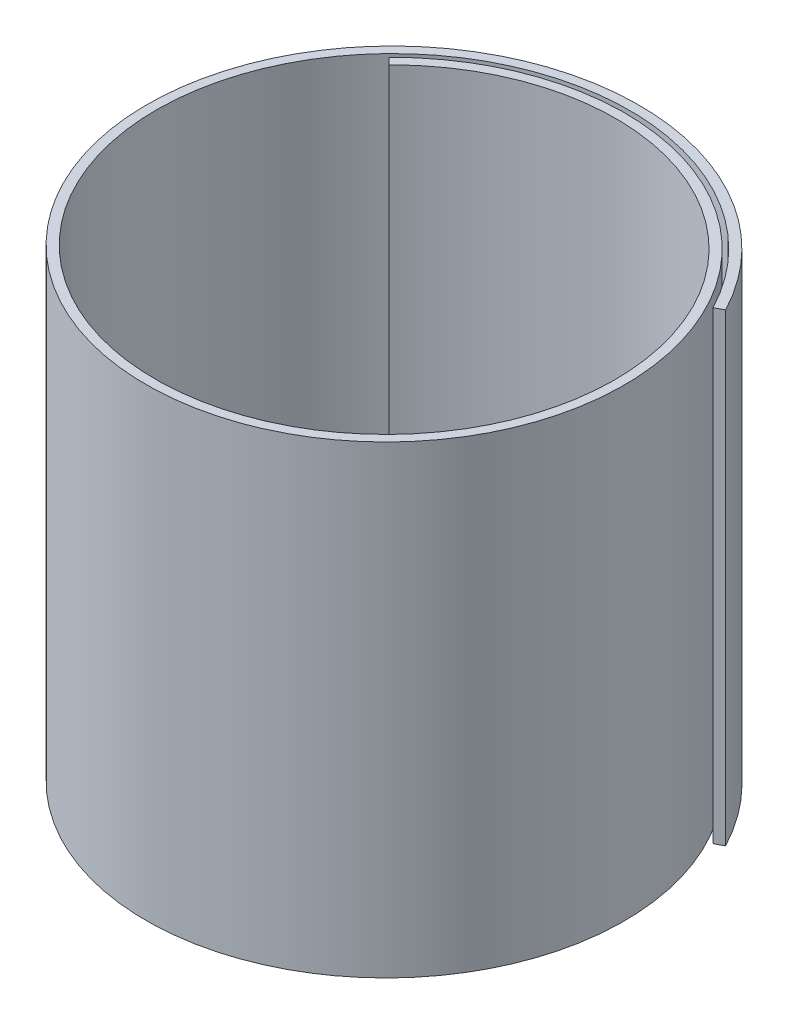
ISO-10303-21;
HEADER;
FILE_DESCRIPTION(('STEP AP214'),'2;1');
FILE_NAME('part.step','',(''),(''),'','','');
FILE_SCHEMA(('AUTOMOTIVE_DESIGN { 1 0 10303 214 1 1 1 1 }'));
ENDSEC;
DATA;
#1=APPLICATION_CONTEXT('core data for automotive mechanical design processes');
#2=APPLICATION_PROTOCOL_DEFINITION('international standard','automotive_design',2000,#1);
#3=PRODUCT_CONTEXT('',#1,'mechanical');
#4=PRODUCT('Part','Part','',(#3));
#5=PRODUCT_RELATED_PRODUCT_CATEGORY('part','',(#4));
#6=PRODUCT_DEFINITION_FORMATION('','',#4);
#7=PRODUCT_DEFINITION_CONTEXT('part definition',#1,'design');
#8=PRODUCT_DEFINITION('design','',#6,#7);
#9=PRODUCT_DEFINITION_SHAPE('','',#8);
#10=(LENGTH_UNIT() NAMED_UNIT(*) SI_UNIT(.MILLI.,.METRE.));
#11=(NAMED_UNIT(*) PLANE_ANGLE_UNIT() SI_UNIT($,.RADIAN.));
#12=(NAMED_UNIT(*) SI_UNIT($,.STERADIAN.) SOLID_ANGLE_UNIT());
#13=UNCERTAINTY_MEASURE_WITH_UNIT(LENGTH_MEASURE(1.E-05),#10,'distance_accuracy_value','');
#14=(GEOMETRIC_REPRESENTATION_CONTEXT(3) GLOBAL_UNCERTAINTY_ASSIGNED_CONTEXT((#13)) GLOBAL_UNIT_ASSIGNED_CONTEXT((#10,
#11,#12)) REPRESENTATION_CONTEXT('',''));
#15=CARTESIAN_POINT('',(0.,0.,0.));
#16=DIRECTION('',(0.,0.,1.));
#17=DIRECTION('',(1.,0.,0.));
#18=AXIS2_PLACEMENT_3D('',#15,#16,#17);
#19=CARTESIAN_POINT('',(-35.3553390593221,0.,-35.3553390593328));
#20=DIRECTION('',(0.,1.,1.0918349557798E-13));
#21=DIRECTION('',(0.,-1.0918349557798E-13,1.));
#22=AXIS2_PLACEMENT_3D('',#19,#20,#21);
#23=PLANE('',#22);
#24=DIRECTION('',(0.713826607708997,0.,0.700322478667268));
#25=VECTOR('',#24,1.);
#26=CARTESIAN_POINT('',(-35.3553390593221,0.,-35.3553390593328));
#27=LINE('',#26,#25);
#28=CARTESIAN_POINT('',(-35.3553390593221,0.,-35.3553390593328));
#29=VERTEX_POINT('',#28);
#30=CARTESIAN_POINT('',(-33.9276858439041,0.,-33.9546941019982));
#31=VERTEX_POINT('',#30);
#32=EDGE_CURVE('E14',#29,#31,#27,.T.);
#33=ORIENTED_EDGE('',*,*,#32,.F.);
#34=CARTESIAN_POINT('',(48.0252516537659,0.,-24.4700879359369));
#35=CARTESIAN_POINT('',(45.907021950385,0.,-28.5378635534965));
#36=CARTESIAN_POINT('',(40.631550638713,0.,-36.120086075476));
#37=CARTESIAN_POINT('',(30.1265845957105,0.,-45.1064450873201));
#38=CARTESIAN_POINT('',(17.7210925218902,0.,-51.1352587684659));
#39=CARTESIAN_POINT('',(4.22602425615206,0.,-53.8300307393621));
#40=CARTESIAN_POINT('',(-9.48087307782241,0.,-53.0316375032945));
#41=CARTESIAN_POINT('',(-22.5121447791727,0.,-48.8076353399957));
#42=CARTESIAN_POINT('',(-34.0280868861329,0.,-41.4468574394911));
#43=CARTESIAN_POINT('',(-43.2908529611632,0.,-31.4397178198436));
#44=CARTESIAN_POINT('',(-49.7117230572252,0.,-19.4455618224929));
#45=CARTESIAN_POINT('',(-52.8885070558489,0.,-6.24923529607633));
#46=CARTESIAN_POINT('',(-52.6307069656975,0.,7.2902675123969));
#47=CARTESIAN_POINT('',(-48.9708659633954,0.,20.2957177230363));
#48=CARTESIAN_POINT('',(-42.1614332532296,0.,31.9284877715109));
#49=CARTESIAN_POINT('',(-32.6574144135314,0.,41.4426271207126));
#50=CARTESIAN_POINT('',(-21.0859957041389,0.,48.2326909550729));
#51=CARTESIAN_POINT('',(-8.20516844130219,0.,51.8722555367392));
#52=CARTESIAN_POINT('',(5.14591785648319,0.,52.1406709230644));
#53=CARTESIAN_POINT('',(18.1016221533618,0.,49.0363744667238));
#54=CARTESIAN_POINT('',(29.8259372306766,0.,42.7759661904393));
#55=CARTESIAN_POINT('',(39.5664346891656,0.,33.7791724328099));
#56=CARTESIAN_POINT('',(46.7025487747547,0.,22.6407369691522));
#57=CARTESIAN_POINT('',(50.785100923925,0.,10.091120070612));
#58=CARTESIAN_POINT('',(51.5645484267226,0.,-3.05139843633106));
#59=CARTESIAN_POINT('',(49.0061823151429,0.,-15.9340719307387));
#60=CARTESIAN_POINT('',(43.2913526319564,0.,-27.7250169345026));
#61=CARTESIAN_POINT('',(34.8047081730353,0.,-37.6669305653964));
#62=CARTESIAN_POINT('',(24.1083424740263,0.,-45.1257255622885));
#63=CARTESIAN_POINT('',(11.9045831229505,0.,-49.6309639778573));
#64=CARTESIAN_POINT('',(-1.01011852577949,0.,-50.9054977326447));
#65=CARTESIAN_POINT('',(-13.7971531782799,0.,-48.8824972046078));
#66=CARTESIAN_POINT('',(-25.6302420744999,0.,-43.7086673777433));
#67=CARTESIAN_POINT('',(-32.3758632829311,0.,-38.3922672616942));
#68=CARTESIAN_POINT('',(-35.3553390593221,0.,-35.3553390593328));
#69=B_SPLINE_CURVE_WITH_KNOTS('',3,(#34,#35,#36,#37,#38,#39,#40,#41,#42,#43,#44,#45,#46,#47,#48,
#49,#50,#51,#52,#53,#54,#55,#56,#57,#58,#59,#60,#61,#62,#63,#64,#65,#66,#67,#68),.UNSPECIFIED.,
.F.,.F.,(4,1,1,1,1,1,1,1,1,1,1,1,1,1,1,1,1,1,1,1,1,1,1,1,1,1,1,1,1,1,1,1,4),(0.,
0.0312500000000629,0.0625000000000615,0.0937500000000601,0.125000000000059,0.156250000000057,
0.187500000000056,0.218750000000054,0.250000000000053,0.281250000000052,0.31250000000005,
0.343750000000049,0.375000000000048,0.406250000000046,0.437500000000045,0.468750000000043,
0.500000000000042,0.531250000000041,0.562500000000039,0.593750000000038,0.625000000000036,
0.656250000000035,0.687500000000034,0.718750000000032,0.750000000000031,0.781250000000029,
0.812500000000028,0.843750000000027,0.875000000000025,0.906250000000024,0.937500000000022,
0.968750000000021,1.),.UNSPECIFIED.);
#70=CARTESIAN_POINT('',(48.0252516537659,0.,-24.4700879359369));
#71=VERTEX_POINT('',#70);
#72=EDGE_CURVE('E112',#29,#71,#69,.F.);
#73=ORIENTED_EDGE('',*,*,#72,.T.);
#74=DIRECTION('',(-0.886950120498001,0.,0.461865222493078));
#75=VECTOR('',#74,1.);
#76=CARTESIAN_POINT('',(48.0252516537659,0.,-24.4700879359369));
#77=LINE('',#76,#75);
#78=CARTESIAN_POINT('',(46.2513514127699,0.,-23.5463574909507));
#79=VERTEX_POINT('',#78);
#80=EDGE_CURVE('E69',#71,#79,#77,.T.);
#81=ORIENTED_EDGE('',*,*,#80,.T.);
#82=CARTESIAN_POINT('',(46.2513514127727,6.15445278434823E-11,-23.5463574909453));
#83=CARTESIAN_POINT('',(45.9964711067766,4.62770042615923E-11,-24.0358208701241));
#84=CARTESIAN_POINT('',(45.7337406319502,2.93438033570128E-11,-24.5211942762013));
#85=CARTESIAN_POINT('',(45.1929467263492,4.66080339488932E-12,-25.4832110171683));
#86=CARTESIAN_POINT('',(44.9148859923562,-3.0906054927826E-12,-25.9598558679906));
#87=CARTESIAN_POINT('',(44.3437688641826,3.0899612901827E-12,-26.9039389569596));
#88=CARTESIAN_POINT('',(44.0507156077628,1.70174176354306E-11,-27.3713790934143));
#89=CARTESIAN_POINT('',(43.4499520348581,5.8555277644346E-11,-28.2965777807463));
#90=CARTESIAN_POINT('',(43.1422453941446,8.61622659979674E-11,-28.7543387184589));
#91=CARTESIAN_POINT('',(42.512515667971,6.73910375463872E-11,-29.6597044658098));
#92=CARTESIAN_POINT('',(42.1904968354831,2.10346584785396E-11,-30.1073122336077));
#93=CARTESIAN_POINT('',(41.5324850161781,-2.10274658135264E-11,-30.9918982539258));
#94=CARTESIAN_POINT('',(41.1964968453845,-1.67505252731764E-11,-31.428880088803));
#95=CARTESIAN_POINT('',(40.5108903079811,1.67440543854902E-11,-32.2917421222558));
#96=CARTESIAN_POINT('',(40.1612772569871,4.59520580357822E-11,-32.7176265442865));
#97=CARTESIAN_POINT('',(39.4487661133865,4.38064784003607E-11,-33.5578235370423));
#98=CARTESIAN_POINT('',(39.0858737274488,1.24786168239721E-11,-33.9721409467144));
#99=CARTESIAN_POINT('',(38.3470930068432,-1.2474915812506E-11,-34.7887989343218));
#100=CARTESIAN_POINT('',(37.9712085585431,-6.11176614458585E-12,-35.1911430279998));
#101=CARTESIAN_POINT('',(37.2068348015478,6.11075772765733E-12,-35.9835449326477));
#102=CARTESIAN_POINT('',(36.818347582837,1.19702148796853E-11,-36.3736047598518));
#103=CARTESIAN_POINT('',(36.029213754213,8.7509822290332E-11,-37.1410631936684));
#104=CARTESIAN_POINT('',(35.628569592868,1.57177202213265E-10,-37.5184643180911));
#105=CARTESIAN_POINT('',(34.8155693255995,1.50381272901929E-10,-38.2602310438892));
#106=CARTESIAN_POINT('',(34.4032160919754,7.39535016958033E-11,-38.6245997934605));
#107=CARTESIAN_POINT('',(33.5672466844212,3.14964618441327E-11,-39.3399287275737));
#108=CARTESIAN_POINT('',(33.1436338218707,6.54350838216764E-11,-39.6908927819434));
#109=CARTESIAN_POINT('',(32.2855955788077,4.2830291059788E-11,-40.3790407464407));
#110=CARTESIAN_POINT('',(31.8511739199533,-1.36823927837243E-11,-40.7162292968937));
#111=CARTESIAN_POINT('',(30.9719697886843,1.36771107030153E-11,-41.3764563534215));
#112=CARTESIAN_POINT('',(30.5271913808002,9.74951109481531E-11,-41.699500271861));
#113=CARTESIAN_POINT('',(29.6277261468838,1.2964963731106E-10,-42.3310703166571));
#114=CARTESIAN_POINT('',(29.1730436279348,7.80439341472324E-11,-42.6396025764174));
#115=CARTESIAN_POINT('',(28.2541515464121,3.80330359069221E-11,-43.2418307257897));
#116=CARTESIAN_POINT('',(27.7899448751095,4.96089353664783E-11,-43.5355310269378));
#117=CARTESIAN_POINT('',(26.8524597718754,6.8836635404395E-11,-44.1078952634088));
#118=CARTESIAN_POINT('',(26.3791828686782,7.6489091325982E-11,-44.3865617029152));
#119=CARTESIAN_POINT('',(25.4240817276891,4.42093710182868E-11,-44.9286086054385));
#120=CARTESIAN_POINT('',(24.9422592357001,4.28680618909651E-12,-45.1919921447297));
#121=CARTESIAN_POINT('',(23.9705930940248,-4.28575619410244E-12,-45.7032247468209));
#122=CARTESIAN_POINT('',(23.4807514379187,2.70467913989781E-11,-45.9510775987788));
#123=CARTESIAN_POINT('',(22.4935743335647,9.77529148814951E-11,-46.4310019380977));
#124=CARTESIAN_POINT('',(21.9962411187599,1.37124136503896E-10,-46.6630780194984));
#125=CARTESIAN_POINT('',(20.9946092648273,1.16234819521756E-10,-47.1112037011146));
#126=CARTESIAN_POINT('',(20.4903130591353,5.6008256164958E-11,-47.3272587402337));
#127=CARTESIAN_POINT('',(19.4752844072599,7.24073279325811E-11,-47.7430991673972));
#128=CARTESIAN_POINT('',(18.9645545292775,1.48979973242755E-10,-47.9428908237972));
#129=CARTESIAN_POINT('',(17.9371878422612,1.11093465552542E-10,-48.3259635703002));
#130=CARTESIAN_POINT('',(17.4205536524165,-3.28401617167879E-12,-48.5092516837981));
#131=CARTESIAN_POINT('',(16.3818265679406,3.28303134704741E-12,-48.8591060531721));
#132=CARTESIAN_POINT('',(15.85973535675,1.24157001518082E-10,-49.0256773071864));
#133=CARTESIAN_POINT('',(14.810583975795,1.41580153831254E-10,-49.3420196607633));
#134=CARTESIAN_POINT('',(14.2835246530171,3.81669086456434E-11,-49.4917935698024));
#135=CARTESIAN_POINT('',(13.2250062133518,-3.81591799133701E-11,-49.7744323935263));
#136=CARTESIAN_POINT('',(12.6935480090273,-1.10984451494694E-11,-49.9073007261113));
#137=CARTESIAN_POINT('',(11.626802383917,1.10957201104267E-11,-50.1560210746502));
#138=CARTESIAN_POINT('',(11.0915159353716,6.23698819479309E-12,-50.2718772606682));
#139=CARTESIAN_POINT('',(10.0176851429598,-6.23515988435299E-12,-50.4864678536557));
#140=CARTESIAN_POINT('',(9.47914180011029,-1.38477681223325E-11,-50.5852072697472));
#141=CARTESIAN_POINT('',(8.39936906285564,1.38430343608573E-11,-50.7654608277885));
#142=CARTESIAN_POINT('',(7.85814064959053,4.91317754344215E-11,-50.846980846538));
#143=CARTESIAN_POINT('',(6.77356991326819,8.84026971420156E-11,-50.9926942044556));
#144=CARTESIAN_POINT('',(6.23022849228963,9.23970243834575E-11,-51.0568942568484));
#145=CARTESIAN_POINT('',(5.14200343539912,4.56748468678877E-11,-51.1678684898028));
#146=CARTESIAN_POINT('',(4.59712056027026,-5.01821013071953E-12,-51.2146501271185));
#147=CARTESIAN_POINT('',(3.50629834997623,5.0167016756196E-12,-51.290696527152));
#148=CARTESIAN_POINT('',(2.96035938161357,6.57111823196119E-11,-51.3199665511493));
#149=CARTESIAN_POINT('',(1.86791730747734,7.29681140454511E-11,-51.3610375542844));
#150=CARTESIAN_POINT('',(1.32141431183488,1.95497295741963E-11,-51.3728414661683));
#151=CARTESIAN_POINT('',(0.22842106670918,-1.95457608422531E-11,-51.3790185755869));
#152=CARTESIAN_POINT('',(-0.318069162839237,-5.23661653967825E-12,-51.3733953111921));
#153=CARTESIAN_POINT('',(-1.4104590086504,5.23532763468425E-12,-51.3447582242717));
#154=CARTESIAN_POINT('',(-1.95635873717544,1.40259305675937E-12,-51.32174868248));
#155=CARTESIAN_POINT('',(-3.04698946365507,-1.40218092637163E-12,-51.2583811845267));
#156=CARTESIAN_POINT('',(-3.59172075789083,-3.75648241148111E-13,-51.2180283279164));
#157=CARTESIAN_POINT('',(-4.67943648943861,3.75519530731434E-13,-51.1200183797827));
#158=CARTESIAN_POINT('',(-5.22242146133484,1.00600573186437E-13,-51.0623672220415));
#159=CARTESIAN_POINT('',(-6.30606666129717,-1.00561434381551E-13,-50.9298069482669));
#160=CARTESIAN_POINT('',(-6.84672771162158,0.,-50.8549045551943));
#161=CARTESIAN_POINT('',(-7.92514817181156,0.,-50.6878901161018));
#162=CARTESIAN_POINT('',(-8.46290872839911,0.,-50.595785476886));
#163=CARTESIAN_POINT('',(-9.53503653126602,0.,-50.3944010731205));
#164=CARTESIAN_POINT('',(-10.0694047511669,0.,-50.2851264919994));
#165=CARTESIAN_POINT('',(-11.1342848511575,0.,-50.0495723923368));
#166=CARTESIAN_POINT('',(-11.6647973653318,0.,-49.9232957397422));
#167=CARTESIAN_POINT('',(-12.7214188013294,0.,-49.653919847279));
#168=CARTESIAN_POINT('',(-13.2475285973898,0.,-49.5108240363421));
#169=CARTESIAN_POINT('',(-14.2947968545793,0.,-49.2079941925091));
#170=CARTESIAN_POINT('',(-14.8159565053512,0.,-49.0482642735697));
#171=CARTESIAN_POINT('',(-15.8527769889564,0.,-48.7123525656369));
#172=CARTESIAN_POINT('',(-16.3684393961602,0.,-48.5361756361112));
#173=CARTESIAN_POINT('',(-17.3937184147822,0.,-48.1675582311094));
#174=CARTESIAN_POINT('',(-17.9033370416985,0.,-47.9751233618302));
#175=CARTESIAN_POINT('',(-18.9159822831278,0.,-47.5741803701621));
#176=CARTESIAN_POINT('',(-19.4190113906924,0.,-47.365678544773));
#177=CARTESIAN_POINT('',(-20.4179328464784,0.,-46.9327936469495));
#178=CARTESIAN_POINT('',(-20.9138281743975,0.,-46.7084174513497));
#179=CARTESIAN_POINT('',(-21.8980163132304,0.,-46.243940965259));
#180=CARTESIAN_POINT('',(-22.3863113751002,-2.22787434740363E-13,-46.0038454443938));
#181=CARTESIAN_POINT('',(-23.3548950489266,2.22749832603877E-13,-45.508211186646));
#182=CARTESIAN_POINT('',(-23.8351849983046,8.31239115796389E-13,-45.2526750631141));
#183=CARTESIAN_POINT('',(-24.7872760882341,-8.31069516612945E-13,-44.7264735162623));
#184=CARTESIAN_POINT('',(-25.2590789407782,-3.10127999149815E-12,-44.4558111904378));
#185=CARTESIAN_POINT('',(-26.1937135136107,3.10051291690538E-12,-43.899673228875));
#186=CARTESIAN_POINT('',(-26.6565474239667,1.15698594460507E-11,-43.6142012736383));
#187=CARTESIAN_POINT('',(-27.5727625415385,-1.15664436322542E-11,-43.0287619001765));
#188=CARTESIAN_POINT('',(-28.0261464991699,-4.31602624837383E-11,-42.7287987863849));
#189=CARTESIAN_POINT('',(-28.9229811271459,4.31454053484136E-11,-42.1146967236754));
#190=CARTESIAN_POINT('',(-29.3664351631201,1.60993435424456E-10,-41.8005626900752));
#191=CARTESIAN_POINT('',(-30.2429305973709,1.74854424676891E-10,-41.1584401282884));
#192=CARTESIAN_POINT('',(-30.6759759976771,7.09540699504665E-11,-40.8304570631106));
#193=CARTESIAN_POINT('',(-31.5311766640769,3.83281889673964E-11,-40.1609590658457));
#194=CARTESIAN_POINT('',(-31.9533365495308,1.09527079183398E-10,-39.8194500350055));
#195=CARTESIAN_POINT('',(-32.7863563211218,1.03434091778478E-10,-39.1231690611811));
#196=CARTESIAN_POINT('',(-33.1972195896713,2.61871636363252E-11,-38.7684011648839));
#197=CARTESIAN_POINT('',(-34.0073271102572,-2.61827325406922E-11,-38.0459752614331));
#198=CARTESIAN_POINT('',(-34.4065733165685,-1.32297862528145E-12,-37.6783194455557));
#199=CARTESIAN_POINT('',(-35.1930601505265,1.32270801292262E-12,-36.9305422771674));
#200=CARTESIAN_POINT('',(-35.5803032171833,-2.08817314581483E-11,-36.550423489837));
#201=CARTESIAN_POINT('',(-36.3423977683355,2.08765538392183E-11,-35.7781469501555));
#202=CARTESIAN_POINT('',(-36.7172523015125,8.48179148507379E-11,-35.3859922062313));
#203=CARTESIAN_POINT('',(-37.454184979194,1.03748685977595E-10,-34.5900719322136));
#204=CARTESIAN_POINT('',(-37.8162668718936,5.87703335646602E-11,-34.1863098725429));
#205=CARTESIAN_POINT('',(-38.5272708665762,3.22307354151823E-11,-33.3676046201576));
#206=CARTESIAN_POINT('',(-38.8761974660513,5.06476138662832E-11,-32.9526653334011));
#207=CARTESIAN_POINT('',(-39.5605090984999,3.69676525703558E-11,-32.1120366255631));
#208=CARTESIAN_POINT('',(-39.8958993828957,4.89059898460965E-12,-31.686351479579));
#209=CARTESIAN_POINT('',(-40.552758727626,-4.8884833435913E-12,-30.8246628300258));
#210=CARTESIAN_POINT('',(-40.8742337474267,1.73859716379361E-11,-30.3886638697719));
#211=CARTESIAN_POINT('',(-41.5029347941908,2.28909821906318E-11,-29.5067103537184));
#212=CARTESIAN_POINT('',(-41.8101651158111,6.13338469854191E-12,-29.0607588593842));
#213=CARTESIAN_POINT('',(-42.4101628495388,-6.1323442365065E-12,-28.1593403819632));
#214=CARTESIAN_POINT('',(-42.7029327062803,-1.64407993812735E-12,-27.7038750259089));
#215=CARTESIAN_POINT('',(-43.273743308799,1.64374279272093E-12,-26.7839360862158));
#216=CARTESIAN_POINT('',(-43.551787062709,4.44467598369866E-13,-26.3194643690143));
#217=CARTESIAN_POINT('',(-44.0928803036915,-4.44357121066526E-13,-25.3820217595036));
#218=CARTESIAN_POINT('',(-44.3559335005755,-1.34281830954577E-13,-24.909053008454));
#219=CARTESIAN_POINT('',(-44.8667820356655,1.34241996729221E-13,-23.9551266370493));
#220=CARTESIAN_POINT('',(-45.1145818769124,0.,-23.4741714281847));
#221=CARTESIAN_POINT('',(-45.5946618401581,0.,-22.5047835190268));
#222=CARTESIAN_POINT('',(-45.8269472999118,-2.36837571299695E-13,-22.0163534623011));
#223=CARTESIAN_POINT('',(-46.2757385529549,2.36744573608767E-13,-21.0325281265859));
#224=CARTESIAN_POINT('',(-46.4922505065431,8.54102483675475E-13,-20.5371356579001));
#225=CARTESIAN_POINT('',(-46.9092370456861,-8.53732139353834E-13,-19.5398979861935));
#226=CARTESIAN_POINT('',(-47.1097185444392,-3.17764887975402E-12,-19.0380556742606));
#227=CARTESIAN_POINT('',(-47.4944192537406,3.17668221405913E-12,-18.0283509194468));
#228=CARTESIAN_POINT('',(-47.6786433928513,1.18515833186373E-11,-17.5204903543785));
#229=CARTESIAN_POINT('',(-48.030733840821,1.07646884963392E-11,-16.4992276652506));
#230=CARTESIAN_POINT('',(-48.198602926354,1.00602787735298E-12,-15.9858264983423));
#231=CARTESIAN_POINT('',(-48.5178540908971,-1.00582105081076E-12,-14.9540393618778));
#232=CARTESIAN_POINT('',(-48.669239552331,6.73739214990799E-12,-14.4356544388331));
#233=CARTESIAN_POINT('',(-48.9553957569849,1.1650597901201E-11,-13.3944580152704));
#234=CARTESIAN_POINT('',(-49.090170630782,8.82322455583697E-12,-12.8716476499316));
#235=CARTESIAN_POINT('',(-49.3429797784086,7.42712131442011E-12,-11.8221593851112));
#236=CARTESIAN_POINT('',(-49.4610190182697,8.85712532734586E-12,-11.2954826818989));
#237=CARTESIAN_POINT('',(-49.6802329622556,5.23873628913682E-12,-10.2388213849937));
#238=CARTESIAN_POINT('',(-49.7814134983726,1.92588835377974E-13,-9.70883800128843));
#239=CARTESIAN_POINT('',(-49.9667881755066,-1.9251303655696E-13,-8.64612336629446));
#240=CARTESIAN_POINT('',(-50.0509889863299,4.46471278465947E-12,-8.11339327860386));
#241=CARTESIAN_POINT('',(-50.2022845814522,5.27089491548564E-12,-7.04574490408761));
#242=CARTESIAN_POINT('',(-50.2693867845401,1.42354824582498E-12,-6.51082766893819));
#243=CARTESIAN_POINT('',(-50.3863770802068,-1.42311414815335E-12,-5.43927909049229));
#244=CARTESIAN_POINT('',(-50.4362704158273,-4.23907876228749E-13,-4.90264831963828));
#245=CARTESIAN_POINT('',(-50.5188713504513,4.23835597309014E-13,-3.82815853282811));
#246=CARTESIAN_POINT('',(-50.5515818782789,2.72568966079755E-13,-3.29029974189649));
#247=CARTESIAN_POINT('',(-50.5998327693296,1.15870890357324E-13,-2.21392392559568));
#248=CARTESIAN_POINT('',(-50.6153766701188,1.10409394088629E-13,-1.67540705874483));
#249=CARTESIAN_POINT('',(-50.6293116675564,0.,-0.598286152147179));
#250=CARTESIAN_POINT('',(-50.6277070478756,0.,-0.0596821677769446));
#251=CARTESIAN_POINT('',(-50.6073643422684,-2.5659139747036E-13,1.01704158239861));
#252=CARTESIAN_POINT('',(-50.5886313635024,-4.76963086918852E-13,1.55516144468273));
#253=CARTESIAN_POINT('',(-50.5340533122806,-4.02490723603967E-13,2.63034546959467));
#254=CARTESIAN_POINT('',(-50.4982141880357,-1.07825666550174E-13,3.16740993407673));
#255=CARTESIAN_POINT('',(-50.4094473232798,1.07783129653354E-13,4.23991183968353));
#256=CARTESIAN_POINT('',(-50.3565263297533,0.,4.77534983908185));
#257=CARTESIAN_POINT('',(-50.2336212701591,0.,5.84402839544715));
#258=CARTESIAN_POINT('',(-50.163644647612,0.,6.37726980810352));
#259=CARTESIAN_POINT('',(-50.0066434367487,0.,7.44107049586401));
#260=CARTESIAN_POINT('',(-49.9196240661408,0.,7.97163054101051));
#261=CARTESIAN_POINT('',(-49.7286871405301,0.,9.02960681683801));
#262=CARTESIAN_POINT('',(-49.6247724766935,0.,9.55702356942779));
#263=CARTESIAN_POINT('',(-49.4002036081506,0.,10.6081669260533));
#264=CARTESIAN_POINT('',(-49.2795528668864,0.,11.1318942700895));
#265=CARTESIAN_POINT('',(-49.021672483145,0.,12.1751119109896));
#266=CARTESIAN_POINT('',(-48.884446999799,0.,12.6946032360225));
#267=CARTESIAN_POINT('',(-48.5935797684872,0.,13.7288021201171));
#268=CARTESIAN_POINT('',(-48.4399429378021,0.,14.2435110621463));
#269=CARTESIAN_POINT('',(-48.1164176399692,0.,15.2675988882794));
#270=CARTESIAN_POINT('',(-47.9465348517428,0.,15.7769795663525));
#271=CARTESIAN_POINT('',(-47.5906842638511,0.,16.7898652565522));
#272=CARTESIAN_POINT('',(-47.404722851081,0.,17.2933725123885));
#273=CARTESIAN_POINT('',(-47.0168834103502,0.,18.2939671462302));
#274=CARTESIAN_POINT('',(-46.8150123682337,0.,18.791057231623));
#275=CARTESIAN_POINT('',(-46.3954903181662,0.,19.7783536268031));
#276=CARTESIAN_POINT('',(-46.1778441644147,0.,20.2685619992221));
#277=CARTESIAN_POINT('',(-45.7270327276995,0.,21.2416872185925));
#278=CARTESIAN_POINT('',(-45.4938701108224,0.,21.7246053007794));
#279=CARTESIAN_POINT('',(-45.0123165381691,0.,22.6826625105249));
#280=CARTESIAN_POINT('',(-44.7639287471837,0.,23.1578032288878));
#281=CARTESIAN_POINT('',(-44.2522176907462,0.,24.0998182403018));
#282=CARTESIAN_POINT('',(-43.9888981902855,0.,24.5666945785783));
#283=CARTESIAN_POINT('',(-43.4476184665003,0.,25.491694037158));
#284=CARTESIAN_POINT('',(-43.169662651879,0.,25.9498197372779));
#285=CARTESIAN_POINT('',(-42.5994068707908,0.,26.8568320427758));
#286=CARTESIAN_POINT('',(-42.3071119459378,0.,27.3057218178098));
#287=CARTESIAN_POINT('',(-41.7084762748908,0.,28.1937775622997));
#288=CARTESIAN_POINT('',(-41.4021411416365,0.,28.6329473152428));
#289=CARTESIAN_POINT('',(-40.7757247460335,0.,29.5010801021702));
#290=CARTESIAN_POINT('',(-40.4556495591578,0.,29.9300475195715));
#291=CARTESIAN_POINT('',(-39.8020017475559,0.,30.7773624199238));
#292=CARTESIAN_POINT('',(-39.4684332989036,0.,31.195713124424));
#293=CARTESIAN_POINT('',(-38.7881533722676,0.,32.0214668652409));
#294=CARTESIAN_POINT('',(-38.4414441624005,0.,32.4288717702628));
#295=CARTESIAN_POINT('',(-37.7352862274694,0.,33.2323366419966));
#296=CARTESIAN_POINT('',(-37.3758401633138,0.,33.6283989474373));
#297=CARTESIAN_POINT('',(-36.6446140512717,0.,34.4087818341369));
#298=CARTESIAN_POINT('',(-36.2728371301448,0.,34.793105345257));
#299=CARTESIAN_POINT('',(-35.5173564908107,0.,35.5496149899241));
#300=CARTESIAN_POINT('',(-35.1336563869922,2.91760471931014E-13,35.9218047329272));
#301=CARTESIAN_POINT('',(-34.3547380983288,-2.91658373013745E-13,36.6536525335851));
#302=CARTESIAN_POINT('',(-33.9595239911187,-1.08829550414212E-12,37.013314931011));
#303=CARTESIAN_POINT('',(-33.1579878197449,1.08786314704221E-12,37.719715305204));
#304=CARTESIAN_POINT('',(-32.7516702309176,4.05916153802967E-12,38.066458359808));
#305=CARTESIAN_POINT('',(-31.9283380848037,-4.05738060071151E-12,38.7466293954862));
#306=CARTESIAN_POINT('',(-31.5113282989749,-1.5139053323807E-11,39.0800631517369));
#307=CARTESIAN_POINT('',(-30.6669557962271,1.51343918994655E-11,39.7332795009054));
#308=CARTESIAN_POINT('',(-30.2395963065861,5.64733652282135E-11,40.0530662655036));
#309=CARTESIAN_POINT('',(-29.3749489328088,5.59551946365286E-11,40.6787616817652));
#310=CARTESIAN_POINT('',(-28.9376627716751,1.4112381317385E-11,40.98467271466));
#311=CARTESIAN_POINT('',(-28.0536516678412,-1.41094426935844E-11,41.5823348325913));
#312=CARTESIAN_POINT('',(-27.6069287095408,-5.00000809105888E-13,41.8740888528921));
#313=CARTESIAN_POINT('',(-26.7045354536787,4.99874663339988E-13,42.4431560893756));
#314=CARTESIAN_POINT('',(-26.2488674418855,-1.21030777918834E-11,42.7204729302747));
#315=CARTESIAN_POINT('',(-25.3290768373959,1.20994351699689E-11,43.2603864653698));
#316=CARTESIAN_POINT('',(-24.8649568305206,4.88900314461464E-11,43.5229875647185));
#317=CARTESIAN_POINT('',(-23.9287561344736,7.29628737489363E-11,44.0331919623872));
#318=CARTESIAN_POINT('',(-23.4566782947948,6.02624814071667E-11,44.2808004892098));
#319=CARTESIAN_POINT('',(-22.5050567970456,6.36475563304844E-11,44.7607439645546));
#320=CARTESIAN_POINT('',(-22.0255161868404,7.97215626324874E-11,44.9930849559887));
#321=CARTESIAN_POINT('',(-21.0594643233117,4.61281990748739E-11,45.4422198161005));
#322=CARTESIAN_POINT('',(-20.5729562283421,-3.51026163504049E-12,45.6590204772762));
#323=CARTESIAN_POINT('',(-19.5933860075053,3.50917816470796E-12,46.0768370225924));
#324=CARTESIAN_POINT('',(-19.1003259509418,6.01342741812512E-11,46.2778577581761));
#325=CARTESIAN_POINT('',(-18.1081186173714,6.91939671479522E-11,46.6640024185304));
#326=CARTESIAN_POINT('',(-17.6089724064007,2.16465572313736E-11,46.8491290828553));
#327=CARTESIAN_POINT('',(-16.605136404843,-2.16420381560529E-11,47.2033368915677));
#328=CARTESIAN_POINT('',(-16.1004477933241,-1.73940369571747E-11,47.3724213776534));
#329=CARTESIAN_POINT('',(-15.0860721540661,1.73896375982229E-11,47.6943975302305));
#330=CARTESIAN_POINT('',(-14.5763864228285,4.79186619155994E-11,47.8472932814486));
#331=CARTESIAN_POINT('',(-13.5525625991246,8.56190947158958E-11,48.1367464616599));
#332=CARTESIAN_POINT('',(-13.0384258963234,9.27975473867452E-11,48.27330880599));
#333=CARTESIAN_POINT('',(-12.0062468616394,4.18886533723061E-11,48.5299515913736));
#334=CARTESIAN_POINT('',(-11.4882059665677,-1.61757462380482E-11,48.6500378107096));
#335=CARTESIAN_POINT('',(-10.4487657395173,3.07560317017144E-11,48.8735868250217));
#336=CARTESIAN_POINT('',(-9.92736783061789,1.35687131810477E-10,48.9770562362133));
#337=CARTESIAN_POINT('',(-8.88176050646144,1.37388229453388E-10,49.1672323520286));
#338=CARTESIAN_POINT('',(-8.35755243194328,3.42499714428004E-11,49.2539464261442));
#339=CARTESIAN_POINT('',(-7.30678662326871,-3.42393740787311E-11,49.410487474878));
#340=CARTESIAN_POINT('',(-6.78022966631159,3.66915232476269E-13,49.4803196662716));
#341=CARTESIAN_POINT('',(-5.72524473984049,3.64371927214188E-12,49.6031064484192));
#342=CARTESIAN_POINT('',(-5.19681711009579,-2.76743497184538E-11,49.6560639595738));
#343=CARTESIAN_POINT('',(-4.13865309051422,3.05770666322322E-11,49.7450947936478));
#344=CARTESIAN_POINT('',(-3.60891699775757,1.20121250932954E-10,49.7811716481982));
#345=CARTESIAN_POINT('',(-2.5486994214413,1.57956413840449E-10,49.8364363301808));
#346=CARTESIAN_POINT('',(-2.01821816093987,1.06283202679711E-10,49.8556284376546));
#347=CARTESIAN_POINT('',(-0.957074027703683,3.29164118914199E-11,49.8771207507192));
#348=CARTESIAN_POINT('',(-0.426411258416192,1.121377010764E-11,49.8794260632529));
#349=CARTESIAN_POINT('',(0.634531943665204,-1.13102044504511E-11,49.8671439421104));
#350=CARTESIAN_POINT('',(1.16481244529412,-1.21388940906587E-11,49.8525624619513));
#351=CARTESIAN_POINT('',(2.22442723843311,1.17574835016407E-11,49.8065080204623));
#352=CARTESIAN_POINT('',(2.75376182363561,3.64723267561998E-11,49.775041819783));
#353=CARTESIAN_POINT('',(3.81092172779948,1.01897193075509E-10,49.6952213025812));
#354=CARTESIAN_POINT('',(4.33874761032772,1.42600143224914E-10,49.6468744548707));
#355=CARTESIAN_POINT('',(5.39241314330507,1.31499264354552E-10,49.5332889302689));
#356=CARTESIAN_POINT('',(5.91825335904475,7.97241242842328E-11,49.4680554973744));
#357=CARTESIAN_POINT('',(6.96748811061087,5.52989168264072E-11,49.3208265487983));
#358=CARTESIAN_POINT('',(7.49088305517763,8.26351142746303E-11,49.2388339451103));
#359=CARTESIAN_POINT('',(8.5346828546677,5.41137360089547E-11,49.0582219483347));
#360=CARTESIAN_POINT('',(9.05508831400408,-1.72638295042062E-12,48.9596060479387));
#361=CARTESIAN_POINT('',(10.0923640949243,1.72594410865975E-12,48.7458847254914));
#362=CARTESIAN_POINT('',(10.6092352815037,6.09891273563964E-11,48.630783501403));
#363=CARTESIAN_POINT('',(11.6388975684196,7.39715754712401E-11,48.3842308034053));
#364=CARTESIAN_POINT('',(12.151689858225,2.77228330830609E-11,48.2527842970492));
#365=CARTESIAN_POINT('',(13.1726497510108,-2.77130388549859E-11,47.9736823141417));
#366=CARTESIAN_POINT('',(13.6808189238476,-3.69132561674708E-11,47.8260325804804));
#367=CARTESIAN_POINT('',(14.6919885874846,3.68984520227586E-11,47.514667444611));
#368=CARTESIAN_POINT('',(15.194991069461,1.19873397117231E-10,47.350958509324));
#369=CARTESIAN_POINT('',(16.1952846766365,1.42643641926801E-10,47.0076200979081));
#370=CARTESIAN_POINT('',(16.6925782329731,8.25023463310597E-11,46.8279977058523));
#371=CARTESIAN_POINT('',(17.6809928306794,4.72543216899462E-11,46.4529489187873));
#372=CARTESIAN_POINT('',(18.1721157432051,7.21211584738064E-11,46.2575274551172));
#373=CARTESIAN_POINT('',(19.1477784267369,5.59885002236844E-11,45.8511214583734));
#374=CARTESIAN_POINT('',(19.6323193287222,1.50004690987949E-11,45.6401396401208));
#375=CARTESIAN_POINT('',(20.5943265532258,-1.49973131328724E-11,45.2028806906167));
#376=CARTESIAN_POINT('',(21.0717943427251,-4.01799819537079E-12,44.9766067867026));
#377=CARTESIAN_POINT('',(22.0191637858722,4.01697425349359E-12,44.5090334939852));
#378=CARTESIAN_POINT('',(22.489067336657,1.07617934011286E-12,44.2677379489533));
#379=CARTESIAN_POINT('',(23.4208173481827,-1.07585227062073E-12,43.7703931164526));
#380=CARTESIAN_POINT('',(23.8826662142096,-2.88222173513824E-13,43.5143483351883));
#381=CARTESIAN_POINT('',(24.7978167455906,2.88120102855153E-13,42.9877786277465));
#382=CARTESIAN_POINT('',(25.2511213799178,0.,42.7172588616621));
#383=CARTESIAN_POINT('',(26.1486944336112,0.,42.1620145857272));
#384=CARTESIAN_POINT('',(26.5929664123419,0.,41.8772958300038));
#385=CARTESIAN_POINT('',(27.4719868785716,0.,41.2939304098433));
#386=CARTESIAN_POINT('',(27.906739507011,0.,40.9952899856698));
#387=CARTESIAN_POINT('',(28.7663056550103,0.,40.3843098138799));
#388=CARTESIAN_POINT('',(29.19112223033,0.,40.0719743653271));
#389=CARTESIAN_POINT('',(30.0304807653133,0.,39.4339400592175));
#390=CARTESIAN_POINT('',(30.4450245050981,0.,39.1082435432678));
#391=CARTESIAN_POINT('',(31.263430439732,0.,38.4438693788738));
#392=CARTESIAN_POINT('',(31.6672948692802,0.,38.105194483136));
#393=CARTESIAN_POINT('',(32.4639356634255,0.,37.4152478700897));
#394=CARTESIAN_POINT('',(32.85671483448,0.,37.0639793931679));
#395=CARTESIAN_POINT('',(33.6307796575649,0.,36.3492316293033));
#396=CARTESIAN_POINT('',(34.0120687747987,0.,35.9857560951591));
#397=CARTESIAN_POINT('',(34.762749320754,0.,35.2469818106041));
#398=CARTESIAN_POINT('',(35.1321449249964,0.,34.8716873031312));
#399=CARTESIAN_POINT('',(35.8586357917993,0.,34.109664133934));
#400=CARTESIAN_POINT('',(36.2157359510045,0.,33.7229401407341));
#401=CARTESIAN_POINT('',(36.9172353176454,0.,32.9384480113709));
#402=CARTESIAN_POINT('',(37.2616401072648,0.,32.5406848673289));
#403=CARTESIAN_POINT('',(37.937405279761,0.,31.7344396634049));
#404=CARTESIAN_POINT('',(38.2687697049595,0.,31.3259609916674));
#405=CARTESIAN_POINT('',(38.9182150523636,0.,30.4986933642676));
#406=CARTESIAN_POINT('',(39.2362982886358,0.,30.0799062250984));
#407=CARTESIAN_POINT('',(39.858884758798,0.,29.2324931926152));
#408=CARTESIAN_POINT('',(40.1633908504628,0.,28.8038693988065));
#409=CARTESIAN_POINT('',(40.7585274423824,0.,27.9372564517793));
#410=CARTESIAN_POINT('',(41.0491614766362,0.,27.4992697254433));
#411=CARTESIAN_POINT('',(41.6162598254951,0.,26.6144056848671));
#412=CARTESIAN_POINT('',(41.8927284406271,2.38993541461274E-13,26.167531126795));
#413=CARTESIAN_POINT('',(42.4312034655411,-2.3890849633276E-13,25.2653674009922));
#414=CARTESIAN_POINT('',(42.6932149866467,-8.91461744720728E-13,24.8100812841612));
#415=CARTESIAN_POINT('',(43.2024851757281,8.91101655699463E-13,23.8915714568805));
#416=CARTESIAN_POINT('',(43.4497497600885,3.32497120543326E-12,23.4283510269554));
#417=CARTESIAN_POINT('',(43.9292376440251,-3.3234877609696E-12,22.4944499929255));
#418=CARTESIAN_POINT('',(44.1614676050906,-1.24006787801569E-11,22.0237728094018));
#419=CARTESIAN_POINT('',(44.6106367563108,1.23967943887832E-11,21.0753585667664));
#420=CARTESIAN_POINT('',(44.8275807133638,4.62580052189E-11,20.5976237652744));
#421=CARTESIAN_POINT('',(45.246050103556,8.09994741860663E-11,19.6355487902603));
#422=CARTESIAN_POINT('',(45.4475782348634,8.18855170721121E-11,19.1512097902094));
#423=CARTESIAN_POINT('',(45.8350485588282,4.70808100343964E-11,18.1764562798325));
#424=CARTESIAN_POINT('',(46.0209940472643,1.13978158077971E-11,17.6860430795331));
#425=CARTESIAN_POINT('',(46.3771330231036,-1.13948890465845E-11,16.6996726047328));
#426=CARTESIAN_POINT('',(46.5473305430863,1.48292990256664E-12,16.2037167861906));
#427=CARTESIAN_POINT('',(46.8718092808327,-1.48247587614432E-12,15.2067934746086));
#428=CARTESIAN_POINT('',(47.0260953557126,-1.73169083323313E-11,14.7058275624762));
#429=CARTESIAN_POINT('',(47.318588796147,1.73107312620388E-11,13.6994172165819));
#430=CARTESIAN_POINT('',(47.4568018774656,6.77491568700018E-11,13.193974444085));
#431=CARTESIAN_POINT('',(47.716988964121,6.66809983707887E-11,12.179144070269));
#432=CARTESIAN_POINT('',(47.8389695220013,1.52156835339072E-11,11.6697581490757));
#433=CARTESIAN_POINT('',(48.06653344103,-1.52088785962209E-11,10.6475750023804));
#434=CARTESIAN_POINT('',(48.1721241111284,5.79945738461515E-12,10.1347794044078));
#435=CARTESIAN_POINT('',(48.3667683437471,-5.79763625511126E-12,9.1062259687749));
#436=CARTESIAN_POINT('',(48.455827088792,-3.83862323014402E-11,8.59046911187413));
#437=CARTESIAN_POINT('',(48.6173987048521,3.83794805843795E-11,7.55646386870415));
#438=CARTESIAN_POINT('',(48.6899144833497,1.47708824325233E-10,7.03821593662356));
#439=CARTESIAN_POINT('',(48.8183720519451,1.27749474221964E-10,5.99978218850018));
#440=CARTESIAN_POINT('',(48.8743173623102,-1.48849559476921E-12,5.47959680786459));
#441=CARTESIAN_POINT('',(48.9696075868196,1.48811240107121E-12,4.43784298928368));
#442=CARTESIAN_POINT('',(49.0089567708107,1.33635391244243E-10,3.91627494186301));
#443=CARTESIAN_POINT('',(49.071030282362,1.43429519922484E-10,2.87231110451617));
#444=CARTESIAN_POINT('',(49.093759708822,2.11544701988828E-11,2.3499156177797));
#445=CARTESIAN_POINT('',(49.1225712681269,-2.11469059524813E-11,1.30485246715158));
#446=CARTESIAN_POINT('',(49.128659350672,5.87544647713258E-11,0.782184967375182));
#447=CARTESIAN_POINT('',(49.1241678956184,8.0017815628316E-11,-0.262866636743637));
#448=CARTESIAN_POINT('',(49.1135951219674,2.14360121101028E-11,-0.785250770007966));
#449=CARTESIAN_POINT('',(49.0757637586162,-2.14264019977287E-11,-1.82918079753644));
#450=CARTESIAN_POINT('',(49.0485126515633,-5.74031124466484E-12,-2.35072696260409));
#451=CARTESIAN_POINT('',(48.9773027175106,5.7385042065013E-12,-3.392512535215));
#452=CARTESIAN_POINT('',(48.9333491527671,1.53748974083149E-12,-3.91275230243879));
#453=CARTESIAN_POINT('',(48.828844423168,-1.53721860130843E-12,-4.95146870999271));
#454=CARTESIAN_POINT('',(48.7682961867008,-4.11851831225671E-13,-5.46994564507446));
#455=CARTESIAN_POINT('',(48.630714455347,4.11764043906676E-13,-6.50459488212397));
#456=CARTESIAN_POINT('',(48.5536844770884,1.10317291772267E-13,-7.02076765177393));
#457=CARTESIAN_POINT('',(48.3832535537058,-1.10288819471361E-13,-8.0502663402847));
#458=CARTESIAN_POINT('',(48.2898568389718,0.,-8.56359295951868));
#459=CARTESIAN_POINT('',(48.0868087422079,0.,-9.58685714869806));
#460=CARTESIAN_POINT('',(47.9771623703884,0.,-10.096795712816));
#461=CARTESIAN_POINT('',(47.7417332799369,0.,-11.1127418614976));
#462=CARTESIAN_POINT('',(47.6159563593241,0.,-11.6187507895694));
#463=CARTESIAN_POINT('',(47.348386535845,0.,-12.6262962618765));
#464=CARTESIAN_POINT('',(47.206600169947,0.,-13.1278345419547));
#465=CARTESIAN_POINT('',(46.9071336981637,0.,-14.1258985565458));
#466=CARTESIAN_POINT('',(46.749460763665,0.,-14.6224264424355));
#467=CARTESIAN_POINT('',(46.4183180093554,0.,-15.6100121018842));
#468=CARTESIAN_POINT('',(46.2448531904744,0.,-16.1010715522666));
#469=CARTESIAN_POINT('',(45.8823478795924,0.,-17.0773077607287));
#470=CARTESIAN_POINT('',(45.6933101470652,0.,-17.5624855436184));
#471=CARTESIAN_POINT('',(45.2999038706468,0.,-18.5264640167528));
#472=CARTESIAN_POINT('',(45.0955386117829,0.,-19.0052660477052));
#473=CARTESIAN_POINT('',(44.6717242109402,0.,-19.9559984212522));
#474=CARTESIAN_POINT('',(44.4522789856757,0.,-20.4279305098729));
#475=CARTESIAN_POINT('',(43.9985535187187,0.,-21.3644289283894));
#476=CARTESIAN_POINT('',(43.7642778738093,0.,-21.8289974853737));
#477=CARTESIAN_POINT('',(43.2811423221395,0.,-22.7502755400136));
#478=CARTESIAN_POINT('',(43.0322876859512,2.08205675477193E-13,-23.2069878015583));
#479=CARTESIAN_POINT('',(42.520246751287,-2.08120761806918E-13,-24.1120609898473));
#480=CARTESIAN_POINT('',(42.2570663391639,-7.76560529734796E-13,-24.5604252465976));
#481=CARTESIAN_POINT('',(41.7166279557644,7.76210688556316E-13,-25.4483118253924));
#482=CARTESIAN_POINT('',(41.439376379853,2.89621010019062E-12,-25.8878380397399));
#483=CARTESIAN_POINT('',(40.8710043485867,-2.89529382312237E-12,-26.757631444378));
#484=CARTESIAN_POINT('',(40.5798883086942,-1.08036236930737E-11,-27.1879015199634));
#485=CARTESIAN_POINT('',(39.9841047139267,1.08017083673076E-11,-28.0388403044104));
#486=CARTESIAN_POINT('',(39.6794395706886,4.03087361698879E-11,-28.4595107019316));
#487=CARTESIAN_POINT('',(39.0569186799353,7.07726157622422E-11,-29.2908345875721));
#488=CARTESIAN_POINT('',(38.7390657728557,7.17355838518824E-11,-29.7014902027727));
#489=CARTESIAN_POINT('',(38.0905323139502,3.66473557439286E-11,-30.5123693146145));
#490=CARTESIAN_POINT('',(37.7598551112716,6.05761720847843E-13,-30.9125954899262));
#491=CARTESIAN_POINT('',(37.0860377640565,-6.0557440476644E-13,-31.7022015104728));
#492=CARTESIAN_POINT('',(36.7429015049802,3.42027716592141E-11,-32.0915846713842));
#493=CARTESIAN_POINT('',(36.0445323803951,6.84360627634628E-11,-32.8590916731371));
#494=CARTESIAN_POINT('',(35.6893039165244,6.78737481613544E-11,-33.237219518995));
#495=CARTESIAN_POINT('',(34.9671182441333,3.17513639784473E-11,-33.981804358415));
#496=CARTESIAN_POINT('',(34.6001658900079,-3.79439749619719E-12,-34.3482660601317));
#497=CARTESIAN_POINT('',(33.8549013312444,3.79268392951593E-12,-35.0691090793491));
#498=CARTESIAN_POINT('',(33.4765943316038,4.68900024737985E-11,-35.4234957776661));
#499=CARTESIAN_POINT('',(32.7089268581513,4.6349498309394E-11,-36.1198389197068));
#500=CARTESIAN_POINT('',(32.3195699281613,2.73918055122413E-12,-36.461799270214));
#501=CARTESIAN_POINT('',(31.5301950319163,-2.7386936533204E-12,-37.1330393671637));
#502=CARTESIAN_POINT('',(31.130178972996,3.53792212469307E-11,-37.4623213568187));
#503=CARTESIAN_POINT('',(30.3199388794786,5.10988588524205E-11,-38.1078945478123));
#504=CARTESIAN_POINT('',(29.9097170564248,2.87135810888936E-11,-38.4241885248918));
#505=CARTESIAN_POINT('',(29.079520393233,1.27776624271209E-11,-39.0434763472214));
#506=CARTESIAN_POINT('',(28.6595481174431,1.92195236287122E-11,-39.3464736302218));
#507=CARTESIAN_POINT('',(27.8103069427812,2.04785163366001E-11,-39.9388601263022));
#508=CARTESIAN_POINT('',(27.3810409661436,1.52992507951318E-11,-40.2282535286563));
#509=CARTESIAN_POINT('',(26.5136700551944,2.25665431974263E-11,-40.7931259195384));
#510=CARTESIAN_POINT('',(26.0755683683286,3.50067376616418E-11,-41.068609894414));
#511=CARTESIAN_POINT('',(25.1909848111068,3.69842183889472E-11,-41.6053588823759));
#512=CARTESIAN_POINT('',(24.7445064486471,2.65308884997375E-11,-41.8666296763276));
#513=CARTESIAN_POINT('',(23.8436288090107,7.5571580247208E-12,-42.3746499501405));
#514=CARTESIAN_POINT('',(23.389233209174,-9.64115465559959E-13,-42.6214059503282));
#515=CARTESIAN_POINT('',(22.4729048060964,9.63808912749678E-13,-43.1001362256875));
#516=CARTESIAN_POINT('',(22.0109744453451,1.14069757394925E-11,-43.3321151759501));
#517=CARTESIAN_POINT('',(21.0800182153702,1.87377115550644E-11,-43.7811486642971));
#518=CARTESIAN_POINT('',(20.6109936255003,1.56276963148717E-11,-43.9982058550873));
#519=CARTESIAN_POINT('',(19.6663644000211,1.25075811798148E-11,-44.4172105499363));
#520=CARTESIAN_POINT('',(19.1907612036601,1.24968136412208E-11,-44.619161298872));
#521=CARTESIAN_POINT('',(18.2334918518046,1.3603139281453E-11,-45.00776912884));
#522=CARTESIAN_POINT('',(17.7518273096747,1.47199383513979E-11,-45.194430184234));
#523=CARTESIAN_POINT('',(16.7829533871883,9.32182285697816E-12,-45.5522763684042));
#524=CARTESIAN_POINT('',(16.2957457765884,2.80927998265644E-12,-45.7234662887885));
#525=CARTESIAN_POINT('',(15.3163046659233,-2.80826311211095E-12,-46.0501898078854));
#526=CARTESIAN_POINT('',(14.8240730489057,-1.91594377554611E-12,-46.2057290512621));
#527=CARTESIAN_POINT('',(13.8351034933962,1.91515666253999E-12,-46.5009728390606));
#528=CARTESIAN_POINT('',(13.3383674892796,4.85309688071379E-12,-46.6406838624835));
#529=CARTESIAN_POINT('',(12.3409086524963,4.00560274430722E-12,-46.9040950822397));
#530=CARTESIAN_POINT('',(11.8401877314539,2.23219013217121E-13,-47.027802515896));
#531=CARTESIAN_POINT('',(10.8351948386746,-2.23147863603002E-13,-47.2590519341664));
#532=CARTESIAN_POINT('',(10.3309240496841,3.11060043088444E-12,-47.3665990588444));
#533=CARTESIAN_POINT('',(9.31929350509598,3.5826853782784E-12,-47.5655014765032));
#534=CARTESIAN_POINT('',(8.81193431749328,7.22128842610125E-13,-47.6568596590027));
#535=CARTESIAN_POINT('',(7.7946712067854,-7.21972897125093E-13,-47.8233352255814));
#536=CARTESIAN_POINT('',(7.284767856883,6.93558401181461E-13,-47.8984561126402));
#537=CARTESIAN_POINT('',(6.26296189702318,1.56117094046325E-12,-48.0324097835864));
#538=CARTESIAN_POINT('',(5.75105984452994,1.01376534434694E-12,-48.0912468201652));
#539=CARTESIAN_POINT('',(4.72580252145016,6.92640319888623E-13,-48.1925874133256));
#540=CARTESIAN_POINT('',(4.21244775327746,9.18679912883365E-13,-48.2350960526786));
#541=CARTESIAN_POINT('',(3.18483137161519,8.15557434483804E-13,-48.3037364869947));
#542=CARTESIAN_POINT('',(2.67057015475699,4.8659678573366E-13,-48.3298742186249));
#543=CARTESIAN_POINT('',(1.64168733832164,1.17677012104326E-13,-48.3657315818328));
#544=CARTESIAN_POINT('',(1.12706597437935,0.,-48.3754579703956));
#545=CARTESIAN_POINT('',(0.0980086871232,0.,-48.378453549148));
#546=CARTESIAN_POINT('',(-0.416427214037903,-1.29520621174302E-13,-48.3717302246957));
#547=CARTESIAN_POINT('',(-1.44465415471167,-1.22960001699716E-13,-48.3417869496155));
#548=CARTESIAN_POINT('',(-1.95844534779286,0.,-48.3185722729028));
#549=CARTESIAN_POINT('',(-2.98493038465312,0.,-48.2557371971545));
#550=CARTESIAN_POINT('',(-3.49762440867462,0.,-48.2161197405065));
#551=CARTESIAN_POINT('',(-4.52137747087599,0.,-48.1205689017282));
#552=CARTESIAN_POINT('',(-5.0324368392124,0.,-48.0646390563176));
#553=CARTESIAN_POINT('',(-6.05238217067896,0.,-47.9365551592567));
#554=CARTESIAN_POINT('',(-6.56126866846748,0.,-47.8644053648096));
#555=CARTESIAN_POINT('',(-7.57632977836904,0.,-47.7039752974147));
#556=CARTESIAN_POINT('',(-8.08250518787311,0.,-47.6157000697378));
#557=CARTESIAN_POINT('',(-9.09160582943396,0.,-47.4231148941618));
#558=CARTESIAN_POINT('',(-9.59453217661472,0.,-47.3188107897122));
#559=CARTESIAN_POINT('',(-10.5965968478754,0.,-47.0942656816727));
#560=CARTESIAN_POINT('',(-11.0957366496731,0.,-46.9740312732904));
#561=CARTESIAN_POINT('',(-12.0896915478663,0.,-46.7177253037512));
#562=CARTESIAN_POINT('',(-12.5845085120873,0.,-46.5816609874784));
#563=CARTESIAN_POINT('',(-13.5693646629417,0.,-46.2937727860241));
#564=CARTESIAN_POINT('',(-14.0594053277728,0.,-46.1419539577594));
#565=CARTESIAN_POINT('',(-15.0342952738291,0.,-45.8227585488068));
#566=CARTESIAN_POINT('',(-15.5191454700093,0.,-45.6553847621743));
#567=CARTESIAN_POINT('',(-16.4831580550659,0.,-45.3053017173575));
#568=CARTESIAN_POINT('',(-16.9623216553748,0.,-45.1225957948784));
#569=CARTESIAN_POINT('',(-17.9144643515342,0.,-44.7420728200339));
#570=CARTESIAN_POINT('',(-18.3874450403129,0.,-44.5442597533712));
#571=CARTESIAN_POINT('',(-19.3267256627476,0.,-44.1337487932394));
#572=CARTESIAN_POINT('',(-19.7930276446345,0.,-43.9210555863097));
#573=CARTESIAN_POINT('',(-20.7184552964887,0.,-43.4810125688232));
#574=CARTESIAN_POINT('',(-21.1775835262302,-3.13215626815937E-13,-43.2536681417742));
#575=CARTESIAN_POINT('',(-22.0881690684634,3.13085676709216E-13,-42.7845527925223));
#576=CARTESIAN_POINT('',(-22.5396294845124,1.16821151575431E-12,-42.5427878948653));
#577=CARTESIAN_POINT('',(-23.4343864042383,-1.16767580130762E-12,-42.045063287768));
#578=CARTESIAN_POINT('',(-23.8776865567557,-4.35683367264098E-12,-41.7891101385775));
#579=CARTESIAN_POINT('',(-24.7557051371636,4.35542607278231E-12,-41.2631982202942));
#580=CARTESIAN_POINT('',(-25.1904262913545,1.62519685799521E-11,-40.9932440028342));
#581=CARTESIAN_POINT('',(-26.0509388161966,2.12907561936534E-11,-40.4396283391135));
#582=CARTESIAN_POINT('',(-26.4767317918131,1.4436401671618E-11,-40.1559693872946));
#583=CARTESIAN_POINT('',(-27.3189653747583,2.49492818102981E-11,-39.5752831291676));
#584=CARTESIAN_POINT('',(-27.7354079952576,4.23112507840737E-11,-39.2782587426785));
#585=CARTESIAN_POINT('',(-28.5585185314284,4.00623915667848E-11,-38.6711825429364));
#586=CARTESIAN_POINT('',(-28.965188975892,2.04612351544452E-11,-38.3611341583));
#587=CARTESIAN_POINT('',(-29.7683337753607,2.24813704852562E-11,-37.7283526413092));
#588=CARTESIAN_POINT('',(-30.1648112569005,4.40898651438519E-11,-37.4056234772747));
#589=CARTESIAN_POINT('',(-30.9471497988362,6.2127355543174E-11,-36.7478248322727));
#590=CARTESIAN_POINT('',(-31.3330146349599,5.85654257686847E-11,-36.4127598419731));
#591=CARTESIAN_POINT('',(-32.0937093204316,3.40892732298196E-11,-35.7306352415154));
#592=CARTESIAN_POINT('',(-32.4685436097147,1.31821338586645E-11,-35.3835805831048));
#593=CARTESIAN_POINT('',(-33.2067591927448,-1.31762020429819E-11,-34.6778245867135));
#594=CARTESIAN_POINT('',(-33.5701455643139,-1.8634349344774E-11,-34.3191285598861));
#595=CARTESIAN_POINT('',(-33.9276858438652,0.,-33.9546941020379));
#596=B_SPLINE_CURVE_WITH_KNOTS('',3,(#82,#83,#84,#85,#86,#87,#88,#89,#90,#91,#92,#93,#94,#95,
#96,#97,#98,#99,#100,#101,#102,#103,#104,#105,#106,#107,#108,#109,#110,#111,#112,#113,#114,#115,
#116,#117,#118,#119,#120,#121,#122,#123,#124,#125,#126,#127,#128,#129,#130,#131,#132,#133,#134,
#135,#136,#137,#138,#139,#140,#141,#142,#143,#144,#145,#146,#147,#148,#149,#150,#151,#152,#153,
#154,#155,#156,#157,#158,#159,#160,#161,#162,#163,#164,#165,#166,#167,#168,#169,#170,#171,#172,
#173,#174,#175,#176,#177,#178,#179,#180,#181,#182,#183,#184,#185,#186,#187,#188,#189,#190,#191,
#192,#193,#194,#195,#196,#197,#198,#199,#200,#201,#202,#203,#204,#205,#206,#207,#208,#209,#210,
#211,#212,#213,#214,#215,#216,#217,#218,#219,#220,#221,#222,#223,#224,#225,#226,#227,#228,#229,
#230,#231,#232,#233,#234,#235,#236,#237,#238,#239,#240,#241,#242,#243,#244,#245,#246,#247,#248,
#249,#250,#251,#252,#253,#254,#255,#256,#257,#258,#259,#260,#261,#262,#263,#264,#265,#266,#267,
#268,#269,#270,#271,#272,#273,#274,#275,#276,#277,#278,#279,#280,#281,#282,#283,#284,#285,#286,
#287,#288,#289,#290,#291,#292,#293,#294,#295,#296,#297,#298,#299,#300,#301,#302,#303,#304,#305,
#306,#307,#308,#309,#310,#311,#312,#313,#314,#315,#316,#317,#318,#319,#320,#321,#322,#323,#324,
#325,#326,#327,#328,#329,#330,#331,#332,#333,#334,#335,#336,#337,#338,#339,#340,#341,#342,#343,
#344,#345,#346,#347,#348,#349,#350,#351,#352,#353,#354,#355,#356,#357,#358,#359,#360,#361,#362,
#363,#364,#365,#366,#367,#368,#369,#370,#371,#372,#373,#374,#375,#376,#377,#378,#379,#380,#381,
#382,#383,#384,#385,#386,#387,#388,#389,#390,#391,#392,#393,#394,#395,#396,#397,#398,#399,#400,
#401,#402,#403,#404,#405,#406,#407,#408,#409,#410,#411,#412,#413,#414,#415,#416,#417,#418,#419,
#420,#421,#422,#423,#424,#425,#426,#427,#428,#429,#430,#431,#432,#433,#434,#435,#436,#437,#438,
#439,#440,#441,#442,#443,#444,#445,#446,#447,#448,#449,#450,#451,#452,#453,#454,#455,#456,#457,
#458,#459,#460,#461,#462,#463,#464,#465,#466,#467,#468,#469,#470,#471,#472,#473,#474,#475,#476,
#477,#478,#479,#480,#481,#482,#483,#484,#485,#486,#487,#488,#489,#490,#491,#492,#493,#494,#495,
#496,#497,#498,#499,#500,#501,#502,#503,#504,#505,#506,#507,#508,#509,#510,#511,#512,#513,#514,
#515,#516,#517,#518,#519,#520,#521,#522,#523,#524,#525,#526,#527,#528,#529,#530,#531,#532,#533,
#534,#535,#536,#537,#538,#539,#540,#541,#542,#543,#544,#545,#546,#547,#548,#549,#550,#551,#552,
#553,#554,#555,#556,#557,#558,#559,#560,#561,#562,#563,#564,#565,#566,#567,#568,#569,#570,#571,
#572,#573,#574,#575,#576,#577,#578,#579,#580,#581,#582,#583,#584,#585,#586,#587,#588,#589,#590,
#591,#592,#593,#594,#595),.UNSPECIFIED.,.F.,.F.,(4,2,2,2,2,2,2,2,2,2,2,2,2,2,2,2,2,2,2,2,2,2,2,
2,2,2,2,2,2,2,2,2,2,2,2,2,2,2,2,2,2,2,2,2,2,2,2,2,2,2,2,2,2,2,2,2,2,2,2,2,2,2,2,2,2,2,2,2,2,2,2,
2,2,2,2,2,2,2,2,2,2,2,2,2,2,2,2,2,2,2,2,2,2,2,2,2,2,2,2,2,2,2,2,2,2,2,2,2,2,2,2,2,2,2,2,2,2,2,2,
2,2,2,2,2,2,2,2,2,2,2,2,2,2,2,2,2,2,2,2,2,2,2,2,2,2,2,2,2,2,2,2,2,2,2,2,2,2,2,2,2,2,2,2,2,2,2,2,
2,2,2,2,2,2,2,2,2,2,2,2,2,2,2,2,2,2,2,2,2,2,2,2,2,2,2,2,2,2,2,2,2,2,2,2,2,2,2,2,2,2,2,2,2,2,2,2,
2,2,2,2,2,2,2,2,2,2,2,2,2,2,2,2,2,2,2,2,2,2,2,2,2,2,2,2,2,2,2,2,2,2,2,2,2,2,2,2,2,4),(0.,
1.6554762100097,3.31066212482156,4.96550303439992,6.61993099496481,8.27387057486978,
9.92724460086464,11.5799799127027,13.2320131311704,14.8835563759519,16.5348271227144,
18.1857674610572,19.836306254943,21.4863648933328,23.1358630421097,24.7847244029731,
26.4328824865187,28.0805474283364,29.7279370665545,31.3749939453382,33.0216473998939,
34.6678192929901,36.3134297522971,37.9584029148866,39.6026726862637,41.2464493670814,
42.8899507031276,44.5331192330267,46.1758843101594,47.818167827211,49.4598899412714,
51.1009748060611,52.7413563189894,54.3812447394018,56.020857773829,57.6601379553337,
59.2990146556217,60.9374097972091,62.5752435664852,64.2124401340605,65.8489333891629,
67.4849335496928,69.120658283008,70.7560501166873,72.3910384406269,74.0255452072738,
75.6594906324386,77.292798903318,78.9254039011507,80.5575158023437,82.1893522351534,
83.8208557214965,85.4519556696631,87.0825740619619,88.7126311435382,90.342051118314,
91.9707678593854,93.5989915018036,95.2269396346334,96.8545547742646,98.4817663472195,
100.108496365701,101.73466510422,103.360196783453,104.985025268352,106.609360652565,
108.23342048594,109.857147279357,111.480470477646,113.103312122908,114.725592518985,
116.347235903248,117.968176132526,119.588623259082,121.208794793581,122.82863324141,
124.448068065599,126.067021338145,127.685413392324,129.303168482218,130.920220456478,
132.536779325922,134.153062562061,135.769012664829,137.384559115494,138.999624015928,
140.614127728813,142.227994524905,143.841158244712,145.453828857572,147.066223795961,
148.678285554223,150.289943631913,151.901120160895,153.511735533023,155.121714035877,
156.730989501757,158.339771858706,159.948278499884,161.556451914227,163.164221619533,
164.771509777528,166.378236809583,167.984327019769,169.589714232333,171.194608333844,
172.799226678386,174.4035117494,176.007393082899,177.610792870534,179.213631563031,
180.815833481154,182.417332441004,184.018338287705,185.619068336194,187.219465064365,
188.819458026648,190.418969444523,192.017919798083,193.616233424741,195.213844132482,
196.810961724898,198.407803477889,200.004311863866,201.600416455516,203.196039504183,
204.791101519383,206.38552685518,207.979249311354,209.572478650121,211.165432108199,
212.758052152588,214.350268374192,215.942003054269,217.533176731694,219.123713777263,
220.713547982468,222.302889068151,223.891954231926,225.480685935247,227.069013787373,
228.65686009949,230.244145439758,231.830794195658,233.416740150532,235.002192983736,
236.587369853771,238.172213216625,239.756652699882,241.340610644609,242.924007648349,
244.506768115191,246.088825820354,247.670390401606,249.251678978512,250.832634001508,
252.413185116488,253.993254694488,255.572763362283,257.151635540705,258.729804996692,
260.30748132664,261.884881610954,263.461948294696,265.038611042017,266.614792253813,
268.190412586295,269.765396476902,271.339677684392,272.913465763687,274.486977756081,
276.060156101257,277.632930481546,279.205223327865,280.776955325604,282.348050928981,
283.918443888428,285.488343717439,287.057967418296,288.627257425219,290.196143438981,
291.76454792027,293.332391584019,294.899598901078,296.466103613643,298.03211519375,
299.597850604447,301.163252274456,302.728249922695,304.292766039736,305.856721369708,
307.420040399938,308.982656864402,310.544780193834,312.106627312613,313.668140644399,
315.229249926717,316.789877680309,318.349944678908,319.909375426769,321.468103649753,
323.026338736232,324.584297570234,326.141922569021,327.699143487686,329.255882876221,
330.812061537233,332.36760399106,333.922443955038,335.476790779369,337.030861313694,
338.584597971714,340.137930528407,341.690781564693,343.243071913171,344.794726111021,
346.345677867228,347.896136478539,349.446318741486,350.996167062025,352.545611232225,
354.094573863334,355.642975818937,357.190741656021,358.73780507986,360.284375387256,
361.830669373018,363.376629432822,364.922185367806,366.467259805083,368.011773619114,
369.555651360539,371.098826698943,372.641508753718,374.183914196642,375.725985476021,
377.267652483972,378.808837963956,380.349462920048,381.889452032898,383.428739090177,
384.967533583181,386.506052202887,388.044236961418,389.582017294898,391.11931546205,
392.656051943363,394.192150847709,395.727545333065,397.262443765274,398.797063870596,
400.331350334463,401.865235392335,403.398644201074,404.931500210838,406.463730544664,
407.995271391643),.UNSPECIFIED.);
#597=EDGE_CURVE('E124',#31,#79,#596,.F.);
#598=ORIENTED_EDGE('',*,*,#597,.F.);
#599=EDGE_LOOP('',(#33,#73,#81,#598));
#600=FACE_BOUND('',#599,.T.);
#601=ADVANCED_FACE('F59',(#600),#23,.F.);
#602=CARTESIAN_POINT('',(48.0252516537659,0.,-24.4700879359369));
#603=DIRECTION('',(-0.461865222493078,1.23119951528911E-13,-0.886950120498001));
#604=DIRECTION('',(0.,-1.,-1.0918349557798E-13));
#605=AXIS2_PLACEMENT_3D('',#602,#603,#604);
#606=PLANE('',#605);
#607=ORIENTED_EDGE('',*,*,#80,.F.);
#608=DIRECTION('',(0.,1.,1.0918349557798E-13));
#609=VECTOR('',#608,1.);
#610=CARTESIAN_POINT('',(48.0252516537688,50.,-24.4700879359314));
#611=LINE('',#610,#609);
#612=CARTESIAN_POINT('',(48.0252516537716,100.,-24.4700879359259));
#613=VERTEX_POINT('',#612);
#614=EDGE_CURVE('E135',#71,#613,#611,.T.);
#615=ORIENTED_EDGE('',*,*,#614,.T.);
#616=DIRECTION('',(-0.886950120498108,0.,0.461865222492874));
#617=VECTOR('',#616,1.);
#618=CARTESIAN_POINT('',(48.0252516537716,100.,-24.4700879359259));
#619=LINE('',#618,#617);
#620=CARTESIAN_POINT('',(46.2513514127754,100.,-23.5463574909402));
#621=VERTEX_POINT('',#620);
#622=EDGE_CURVE('E104',#613,#621,#619,.T.);
#623=ORIENTED_EDGE('',*,*,#622,.T.);
#624=CARTESIAN_POINT('',(46.2513514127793,115.,-23.5463574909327));
#625=CARTESIAN_POINT('',(46.2513514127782,109.583333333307,-23.5463574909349));
#626=CARTESIAN_POINT('',(46.2513514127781,104.166666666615,-23.546357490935));
#627=CARTESIAN_POINT('',(46.2513514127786,93.3333333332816,-23.546357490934));
#628=CARTESIAN_POINT('',(46.2513514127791,87.9166666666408,-23.546357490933));
#629=CARTESIAN_POINT('',(46.2513514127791,77.0833333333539,-23.546357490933));
#630=CARTESIAN_POINT('',(46.2513514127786,71.6666666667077,-23.546357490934));
#631=CARTESIAN_POINT('',(46.2513514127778,60.8333333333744,-23.5463574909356));
#632=CARTESIAN_POINT('',(46.2513514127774,55.4166666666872,-23.5463574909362));
#633=CARTESIAN_POINT('',(46.2513514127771,44.5833333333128,-23.546357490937));
#634=CARTESIAN_POINT('',(46.251351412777,39.1666666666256,-23.5463574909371));
#635=CARTESIAN_POINT('',(46.2513514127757,28.3333333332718,-23.5463574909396));
#636=CARTESIAN_POINT('',(46.2513514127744,22.9166666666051,-23.5463574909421));
#637=CARTESIAN_POINT('',(46.251351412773,12.0833333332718,-23.5463574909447));
#638=CARTESIAN_POINT('',(46.2513514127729,6.66666666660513,-23.5463574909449));
#639=CARTESIAN_POINT('',(46.2513514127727,-4.16666666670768,-23.5463574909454));
#640=CARTESIAN_POINT('',(46.2513514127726,-9.58333333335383,-23.5463574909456));
#641=CARTESIAN_POINT('',(46.2513514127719,-15.,-23.5463574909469));
#642=B_SPLINE_CURVE_WITH_KNOTS('',3,(#624,#625,#626,#627,#628,#629,#630,#631,#632,#633,#634,
#635,#636,#637,#638,#639,#640,#641),.UNSPECIFIED.,.F.,.F.,(4,2,2,2,2,2,2,2,4),(0.,
16.2500000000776,32.5,48.7499999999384,65.,81.2500000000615,97.5000000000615,113.750000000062,
130.),.UNSPECIFIED.);
#643=EDGE_CURVE('E118',#79,#621,#642,.F.);
#644=ORIENTED_EDGE('',*,*,#643,.F.);
#645=EDGE_LOOP('',(#607,#615,#623,#644));
#646=FACE_BOUND('',#645,.T.);
#647=ADVANCED_FACE('F180',(#646),#606,.F.);
#648=CARTESIAN_POINT('',(48.0252516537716,100.,-24.4700879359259));
#649=DIRECTION('',(0.,1.,1.0918349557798E-13));
#650=DIRECTION('',(0.,-1.0918349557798E-13,1.));
#651=AXIS2_PLACEMENT_3D('',#648,#649,#650);
#652=PLANE('',#651);
#653=ORIENTED_EDGE('',*,*,#622,.F.);
#654=CARTESIAN_POINT('',(48.0252516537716,100.,-24.4700879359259));
#655=CARTESIAN_POINT('',(45.9070219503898,100.,-28.5378635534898));
#656=CARTESIAN_POINT('',(40.6315506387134,100.,-36.1200860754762));
#657=CARTESIAN_POINT('',(30.1265845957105,100.,-45.1064450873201));
#658=CARTESIAN_POINT('',(17.7210925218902,100.,-51.1352587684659));
#659=CARTESIAN_POINT('',(4.22602425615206,100.,-53.8300307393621));
#660=CARTESIAN_POINT('',(-9.48087307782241,100.,-53.0316375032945));
#661=CARTESIAN_POINT('',(-22.5121447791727,100.,-48.8076353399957));
#662=CARTESIAN_POINT('',(-34.0280868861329,100.,-41.4468574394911));
#663=CARTESIAN_POINT('',(-43.2908529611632,100.,-31.4397178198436));
#664=CARTESIAN_POINT('',(-49.7117230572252,100.,-19.4455618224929));
#665=CARTESIAN_POINT('',(-52.8885070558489,100.,-6.24923529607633));
#666=CARTESIAN_POINT('',(-52.6307069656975,100.,7.2902675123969));
#667=CARTESIAN_POINT('',(-48.9708659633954,100.,20.2957177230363));
#668=CARTESIAN_POINT('',(-42.1614332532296,100.,31.9284877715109));
#669=CARTESIAN_POINT('',(-32.6574144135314,100.,41.4426271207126));
#670=CARTESIAN_POINT('',(-21.0859957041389,100.,48.2326909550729));
#671=CARTESIAN_POINT('',(-8.20516844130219,100.,51.8722555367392));
#672=CARTESIAN_POINT('',(5.14591785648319,100.,52.1406709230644));
#673=CARTESIAN_POINT('',(18.1016221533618,100.,49.0363744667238));
#674=CARTESIAN_POINT('',(29.8259372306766,100.,42.7759661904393));
#675=CARTESIAN_POINT('',(39.5664346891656,100.,33.7791724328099));
#676=CARTESIAN_POINT('',(46.7025487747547,100.,22.6407369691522));
#677=CARTESIAN_POINT('',(50.785100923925,100.,10.091120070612));
#678=CARTESIAN_POINT('',(51.5645484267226,100.,-3.05139843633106));
#679=CARTESIAN_POINT('',(49.0061823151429,100.,-15.9340719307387));
#680=CARTESIAN_POINT('',(43.2913526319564,100.,-27.7250169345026));
#681=CARTESIAN_POINT('',(34.8047081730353,100.,-37.6669305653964));
#682=CARTESIAN_POINT('',(24.1083424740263,100.,-45.1257255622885));
#683=CARTESIAN_POINT('',(11.9045831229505,100.,-49.6309639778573));
#684=CARTESIAN_POINT('',(-1.01011852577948,100.,-50.9054977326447));
#685=CARTESIAN_POINT('',(-13.7971531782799,100.,-48.8824972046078));
#686=CARTESIAN_POINT('',(-25.6302420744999,100.,-43.7086673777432));
#687=CARTESIAN_POINT('',(-32.3758632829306,100.,-38.3922672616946));
#688=CARTESIAN_POINT('',(-35.3553390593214,100.,-35.3553390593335));
#689=B_SPLINE_CURVE_WITH_KNOTS('',3,(#654,#655,#656,#657,#658,#659,#660,#661,#662,#663,#664,
#665,#666,#667,#668,#669,#670,#671,#672,#673,#674,#675,#676,#677,#678,#679,#680,#681,#682,#683,
#684,#685,#686,#687,#688),.UNSPECIFIED.,.F.,.F.,(4,1,1,1,1,1,1,1,1,1,1,1,1,1,1,1,1,1,1,1,1,1,1,
1,1,1,1,1,1,1,1,1,4),(0.,0.0312500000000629,0.0625000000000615,0.0937500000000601,
0.125000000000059,0.156250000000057,0.187500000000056,0.218750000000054,0.250000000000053,
0.281250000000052,0.31250000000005,0.343750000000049,0.375000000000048,0.406250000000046,
0.437500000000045,0.468750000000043,0.500000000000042,0.531250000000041,0.562500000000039,
0.593750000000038,0.625000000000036,0.656250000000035,0.687500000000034,0.718750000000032,
0.750000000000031,0.781250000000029,0.812500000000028,0.843750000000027,0.875000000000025,
0.906250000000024,0.937500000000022,0.968750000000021,1.),.UNSPECIFIED.);
#690=CARTESIAN_POINT('',(-35.3553390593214,100.,-35.3553390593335));
#691=VERTEX_POINT('',#690);
#692=EDGE_CURVE('E111',#613,#691,#689,.T.);
#693=ORIENTED_EDGE('',*,*,#692,.T.);
#694=DIRECTION('',(0.713826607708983,0.,0.700322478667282));
#695=VECTOR('',#694,1.);
#696=CARTESIAN_POINT('',(-35.3553390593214,100.,-35.3553390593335));
#697=LINE('',#696,#695);
#698=CARTESIAN_POINT('',(-33.9276858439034,100.,-33.954694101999));
#699=VERTEX_POINT('',#698);
#700=EDGE_CURVE('E63',#691,#699,#697,.T.);
#701=ORIENTED_EDGE('',*,*,#700,.T.);
#702=CARTESIAN_POINT('',(31.6837041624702,100.,38.2709516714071));
#703=CARTESIAN_POINT('',(32.444218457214,99.9999999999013,37.6589325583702));
#704=CARTESIAN_POINT('',(33.1918885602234,99.9999999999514,37.0307788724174));
#705=CARTESIAN_POINT('',(34.6378176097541,100.000000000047,35.7599378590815));
#706=CARTESIAN_POINT('',(35.3368751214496,100.000000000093,35.118158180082));
#707=CARTESIAN_POINT('',(36.6865090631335,99.9999999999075,33.8211272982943));
#708=CARTESIAN_POINT('',(37.3378853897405,99.9999999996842,33.1667100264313));
#709=CARTESIAN_POINT('',(38.5930439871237,99.999999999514,31.8455120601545));
#710=CARTESIAN_POINT('',(39.1976209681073,99.9999999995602,31.179487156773));
#711=CARTESIAN_POINT('',(40.3600924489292,99.9999999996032,29.8361487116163));
#712=CARTESIAN_POINT('',(40.9187678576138,99.9999999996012,29.1595117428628));
#713=CARTESIAN_POINT('',(41.9903508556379,99.999999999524,27.7960085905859));
#714=CARTESIAN_POINT('',(42.5040174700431,99.9999999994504,27.1097395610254));
#715=CARTESIAN_POINT('',(43.4865013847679,99.9999999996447,25.7280101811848));
#716=CARTESIAN_POINT('',(43.9560479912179,99.9999999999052,25.0330689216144));
#717=CARTESIAN_POINT('',(44.8512088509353,100.000000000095,23.6350125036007));
#718=CARTESIAN_POINT('',(45.2775155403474,100.00000000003,22.9323411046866));
#719=CARTESIAN_POINT('',(46.0871080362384,99.9999999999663,21.5198216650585));
#720=CARTESIAN_POINT('',(46.4710431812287,99.999999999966,20.8103460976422));
#721=CARTESIAN_POINT('',(47.1967944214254,100.000000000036,19.3851970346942));
#722=CARTESIAN_POINT('',(47.5392116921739,100.000000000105,18.6698299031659));
#723=CARTESIAN_POINT('',(48.1828157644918,99.9999999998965,17.2338602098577));
#724=CARTESIAN_POINT('',(48.4845518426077,99.9999999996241,16.5135039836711));
#725=CARTESIAN_POINT('',(49.0476658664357,99.9999999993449,15.0685053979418));
#726=CARTESIAN_POINT('',(49.3095388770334,99.9999999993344,14.3440560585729));
#727=CARTESIAN_POINT('',(49.7937806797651,99.9999999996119,12.8918108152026));
#728=CARTESIAN_POINT('',(50.0165894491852,99.9999999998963,12.1641616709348));
#729=CARTESIAN_POINT('',(50.4235369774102,100.000000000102,10.7064503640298));
#730=CARTESIAN_POINT('',(50.6080611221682,100.000000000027,9.97649581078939));
#731=CARTESIAN_POINT('',(50.9392535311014,99.999999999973,8.51510491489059));
#732=CARTESIAN_POINT('',(51.086254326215,99.9999999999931,7.78374393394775));
#733=CARTESIAN_POINT('',(51.3431945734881,100.000000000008,6.32047258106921));
#734=CARTESIAN_POINT('',(51.4534164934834,100.000000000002,5.58861179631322));
#735=CARTESIAN_POINT('',(51.637575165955,99.9999999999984,4.12527749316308));
#736=CARTESIAN_POINT('',(51.7117479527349,99.9999999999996,3.39383366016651));
#737=CARTESIAN_POINT('',(51.8245679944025,100.000000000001,1.93227674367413));
#738=CARTESIAN_POINT('',(51.8634090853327,100.,1.20217860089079));
#739=CARTESIAN_POINT('',(51.9063110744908,100.000000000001,-0.255734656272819));
#740=CARTESIAN_POINT('',(51.9105282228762,100.000000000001,-0.983545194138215));
#741=CARTESIAN_POINT('',(51.8849158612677,100.,-2.43592081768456));
#742=CARTESIAN_POINT('',(51.8552097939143,100.,-3.16048809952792));
#743=CARTESIAN_POINT('',(51.7624753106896,99.9999999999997,-4.6054038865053));
#744=CARTESIAN_POINT('',(51.6995422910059,99.9999999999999,-5.32575853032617));
#745=CARTESIAN_POINT('',(51.5410715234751,100.,-6.76126460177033));
#746=CARTESIAN_POINT('',(51.445605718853,100.,-7.47642398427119));
#747=CARTESIAN_POINT('',(51.2227826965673,100.,-8.90054422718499));
#748=CARTESIAN_POINT('',(51.0954782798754,100.,-9.60951335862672));
#749=CARTESIAN_POINT('',(50.8096892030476,99.9999999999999,-11.0202475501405));
#750=CARTESIAN_POINT('',(50.6512421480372,99.9999999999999,-11.7220202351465));
#751=CARTESIAN_POINT('',(50.3038787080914,100.,-13.1173466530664));
#752=CARTESIAN_POINT('',(50.1149882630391,100.,-13.8109068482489));
#753=CARTESIAN_POINT('',(49.7074502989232,100.,-15.1887851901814));
#754=CARTESIAN_POINT('',(49.4888201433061,100.,-15.8731084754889));
#755=CARTESIAN_POINT('',(49.0225176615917,100.,-17.2314829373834));
#756=CARTESIAN_POINT('',(48.7748567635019,100.,-17.905538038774));
#757=CARTESIAN_POINT('',(48.2512113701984,100.,-19.2423404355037));
#758=CARTESIAN_POINT('',(47.9752345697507,100.,-19.9050907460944));
#759=CARTESIAN_POINT('',(47.3956803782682,100.,-21.2182435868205));
#760=CARTESIAN_POINT('',(47.0921087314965,100.,-21.8686486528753));
#761=CARTESIAN_POINT('',(46.4580927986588,100.,-23.1560681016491));
#762=CARTESIAN_POINT('',(46.127653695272,100.,-23.7930850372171));
#763=CARTESIAN_POINT('',(45.4406360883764,100.,-25.0526837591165));
#764=CARTESIAN_POINT('',(45.0840632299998,100.,-25.6752686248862));
#765=CARTESIAN_POINT('',(44.345516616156,100.,-26.9049583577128));
#766=CARTESIAN_POINT('',(43.9635496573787,100.,-27.5120673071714));
#767=CARTESIAN_POINT('',(43.1749590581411,100.,-28.7097616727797));
#768=CARTESIAN_POINT('',(42.7683437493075,100.,-29.3003525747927));
#769=CARTESIAN_POINT('',(41.9312042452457,100.,-30.4639681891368));
#770=CARTESIAN_POINT('',(41.5006900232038,100.,-31.0370000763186));
#771=CARTESIAN_POINT('',(40.6165107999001,100.,-32.1644632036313));
#772=CARTESIAN_POINT('',(40.1628572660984,100.,-32.7189034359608));
#773=CARTESIAN_POINT('',(39.2331317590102,100.,-33.8081457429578));
#774=CARTESIAN_POINT('',(38.7570719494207,100.,-34.3429581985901));
#775=CARTESIAN_POINT('',(37.7832218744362,100.,-35.3921265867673));
#776=CARTESIAN_POINT('',(37.2854379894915,100.,-35.9064884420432));
#777=CARTESIAN_POINT('',(36.2690997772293,100.,-36.9140076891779));
#778=CARTESIAN_POINT('',(35.7505505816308,100.,-37.4071702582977));
#779=CARTESIAN_POINT('',(34.6936567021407,99.9999999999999,-38.3714627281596));
#780=CARTESIAN_POINT('',(34.1553183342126,99.9999999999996,-38.8425995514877));
#781=CARTESIAN_POINT('',(33.0598338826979,100.,-39.7620222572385));
#782=CARTESIAN_POINT('',(32.5026953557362,100.000000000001,-40.210317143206));
#783=CARTESIAN_POINT('',(31.3706019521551,99.9999999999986,-41.0832427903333));
#784=CARTESIAN_POINT('',(30.7956557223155,99.9999999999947,-41.5078847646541));
#785=CARTESIAN_POINT('',(29.6289311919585,100.000000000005,-42.3326888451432));
#786=CARTESIAN_POINT('',(29.0371622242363,100.00000000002,-42.7328641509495));
#787=CARTESIAN_POINT('',(27.8376562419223,100.000000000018,-43.5080626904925));
#788=CARTESIAN_POINT('',(27.2299246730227,100.000000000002,-43.883094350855));
#789=CARTESIAN_POINT('',(25.9995761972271,99.9999999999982,-44.6075374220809));
#790=CARTESIAN_POINT('',(25.3769628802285,100.000000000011,-44.9569549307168));
#791=CARTESIAN_POINT('',(24.1180012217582,100.000000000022,-45.6296177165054));
#792=CARTESIAN_POINT('',(23.481657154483,100.000000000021,-45.9528709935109));
#793=CARTESIAN_POINT('',(22.1963929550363,100.000000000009,-46.5726638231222));
#794=CARTESIAN_POINT('',(21.5474777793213,99.9999999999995,-46.869213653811));
#795=CARTESIAN_POINT('',(20.2382319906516,100.000000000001,-47.435061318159));
#796=CARTESIAN_POINT('',(19.5779068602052,100.000000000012,-47.7043718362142));
#797=CARTESIAN_POINT('',(18.2470030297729,100.000000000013,-48.215209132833));
#798=CARTESIAN_POINT('',(17.5764300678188,100.000000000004,-48.4567508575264));
#799=CARTESIAN_POINT('',(16.2260573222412,99.9999999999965,-48.9115707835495));
#800=CARTESIAN_POINT('',(15.546261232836,99.9999999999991,-49.1248599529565));
#801=CARTESIAN_POINT('',(14.1785607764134,100.000000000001,-49.5229888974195));
#802=CARTESIAN_POINT('',(13.4906583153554,100.,-49.7078352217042));
#803=CARTESIAN_POINT('',(12.1079960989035,99.9999999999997,-50.0488407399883));
#804=CARTESIAN_POINT('',(11.4132384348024,99.9999999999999,-50.205008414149));
#805=CARTESIAN_POINT('',(10.018120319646,100.,-50.4884239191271));
#806=CARTESIAN_POINT('',(9.3177620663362,100.,-50.6156825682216));
#807=CARTESIAN_POINT('',(7.91269868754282,100.,-50.8410506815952));
#808=CARTESIAN_POINT('',(7.20799569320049,100.,-50.9391734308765));
#809=CARTESIAN_POINT('',(5.79549908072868,100.,-51.1060544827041));
#810=CARTESIAN_POINT('',(5.08770730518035,100.,-51.1748283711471));
#811=CARTESIAN_POINT('',(3.67018434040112,100.,-51.2827803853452));
#812=CARTESIAN_POINT('',(2.96045414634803,100.,-51.321971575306));
#813=CARTESIAN_POINT('',(1.54014196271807,100.,-51.3708278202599));
#814=CARTESIAN_POINT('',(0.829560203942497,100.,-51.3804995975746));
#815=CARTESIAN_POINT('',(-0.591190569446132,100.,-51.3704124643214));
#816=CARTESIAN_POINT('',(-1.30135964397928,100.,-51.3506619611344));
#817=CARTESIAN_POINT('',(-2.7200156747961,100.,-51.2818183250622));
#818=CARTESIAN_POINT('',(-3.42850314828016,100.,-51.2327358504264));
#819=CARTESIAN_POINT('',(-4.8425255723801,100.,-51.1053224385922));
#820=CARTESIAN_POINT('',(-5.54806169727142,100.,-51.0270045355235));
#821=CARTESIAN_POINT('',(-6.95491446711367,100.,-50.8412306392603));
#822=CARTESIAN_POINT('',(-7.65623312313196,99.9999999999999,-50.7337898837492));
#823=CARTESIAN_POINT('',(-9.05344598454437,100.,-50.489832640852));
#824=CARTESIAN_POINT('',(-9.74934265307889,100.,-50.3533302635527));
#825=CARTESIAN_POINT('',(-11.1346929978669,99.9999999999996,-50.051540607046));
#826=CARTESIAN_POINT('',(-11.8241481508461,99.9999999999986,-49.8862601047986));
#827=CARTESIAN_POINT('',(-13.1954310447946,100.000000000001,-49.5273340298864));
#828=CARTESIAN_POINT('',(-13.877260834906,100.000000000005,-49.3336962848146));
#829=CARTESIAN_POINT('',(-15.2320891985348,100.000000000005,-48.9184567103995));
#830=CARTESIAN_POINT('',(-15.905090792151,100.000000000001,-48.6968647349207));
#831=CARTESIAN_POINT('',(-17.2410600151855,99.9999999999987,-48.2261276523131));
#832=CARTESIAN_POINT('',(-17.9040318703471,99.9999999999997,-47.9769945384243));
#833=CARTESIAN_POINT('',(-19.2187456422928,100.,-47.4516000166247));
#834=CARTESIAN_POINT('',(-19.8704931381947,100.,-47.1753525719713));
#835=CARTESIAN_POINT('',(-21.1615857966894,99.9999999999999,-46.5961039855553));
#836=CARTESIAN_POINT('',(-21.8009371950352,99.9999999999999,-46.29311674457));
#837=CARTESIAN_POINT('',(-23.0663132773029,100.,-45.6608734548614));
#838=CARTESIAN_POINT('',(-23.692341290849,100.,-45.3316240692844));
#839=CARTESIAN_POINT('',(-24.9300524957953,99.9999999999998,-44.6475617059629));
#840=CARTESIAN_POINT('',(-25.5417394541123,99.9999999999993,-44.2927555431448));
#841=CARTESIAN_POINT('',(-26.7497061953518,100.000000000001,-43.5582668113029));
#842=CARTESIAN_POINT('',(-27.3459911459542,100.000000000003,-43.1785927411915));
#843=CARTESIAN_POINT('',(-28.5220965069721,100.000000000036,-42.3950681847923));
#844=CARTESIAN_POINT('',(-29.1019237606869,100.000000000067,-41.9912279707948));
#845=CARTESIAN_POINT('',(-30.2440641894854,100.000000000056,-41.1600804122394));
#846=CARTESIAN_POINT('',(-30.8063860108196,100.000000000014,-40.732784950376));
#847=CARTESIAN_POINT('',(-31.9124663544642,99.9999999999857,-39.855401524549));
#848=CARTESIAN_POINT('',(-32.4562347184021,99.9999999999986,-39.4053259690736));
#849=CARTESIAN_POINT('',(-33.5243993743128,100.000000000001,-38.4830435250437));
#850=CARTESIAN_POINT('',(-34.0488010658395,99.9999999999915,-38.0108428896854));
#851=CARTESIAN_POINT('',(-35.0774485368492,100.000000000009,-37.0452363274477));
#852=CARTESIAN_POINT('',(-35.5816994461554,100.000000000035,-36.5518358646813));
#853=CARTESIAN_POINT('',(-36.569191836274,100.000000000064,-35.5447589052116));
#854=CARTESIAN_POINT('',(-37.0524401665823,100.000000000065,-35.0310891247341));
#855=CARTESIAN_POINT('',(-37.9970832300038,100.000000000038,-33.9844157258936));
#856=CARTESIAN_POINT('',(-38.4584868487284,100.00000000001,-33.4514201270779));
#857=CARTESIAN_POINT('',(-39.3586028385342,99.9999999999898,-32.3670420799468));
#858=CARTESIAN_POINT('',(-39.7973262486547,99.9999999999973,-31.8156687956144));
#859=CARTESIAN_POINT('',(-40.6512387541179,100.000000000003,-30.6954676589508));
#860=CARTESIAN_POINT('',(-41.0664406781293,100.000000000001,-30.1266495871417));
#861=CARTESIAN_POINT('',(-41.8726434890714,99.9999999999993,-28.9723849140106));
#862=CARTESIAN_POINT('',(-42.2636520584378,99.9999999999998,-28.3869436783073));
#863=CARTESIAN_POINT('',(-43.0209600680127,100.,-27.2004979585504));
#864=CARTESIAN_POINT('',(-43.3872655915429,100.,-26.5994973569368));
#865=CARTESIAN_POINT('',(-44.094578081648,100.,-25.3830448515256));
#866=CARTESIAN_POINT('',(-44.4355930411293,100.,-24.7675975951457));
#867=CARTESIAN_POINT('',(-45.0917466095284,100.,-23.5233736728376));
#868=CARTESIAN_POINT('',(-45.4068954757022,100.,-22.8946024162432));
#869=CARTESIAN_POINT('',(-46.0107432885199,100.,-21.6248543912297));
#870=CARTESIAN_POINT('',(-46.2994548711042,100.,-20.9838836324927));
#871=CARTESIAN_POINT('',(-46.8498559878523,100.,-19.6908590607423));
#872=CARTESIAN_POINT('',(-47.111560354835,100.,-19.0388115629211));
#873=CARTESIAN_POINT('',(-47.6074594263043,100.,-17.7246121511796));
#874=CARTESIAN_POINT('',(-47.8416642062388,100.,-17.0624640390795));
#875=CARTESIAN_POINT('',(-48.2823423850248,100.,-15.7291805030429));
#876=CARTESIAN_POINT('',(-48.488822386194,100.,-15.0580472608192));
#877=CARTESIAN_POINT('',(-48.8737655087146,100.,-13.708016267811));
#878=CARTESIAN_POINT('',(-49.0522371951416,100.,-13.0291209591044));
#879=CARTESIAN_POINT('',(-49.3808872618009,100.,-11.664793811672));
#880=CARTESIAN_POINT('',(-49.5310765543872,100.,-10.9793646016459));
#881=CARTESIAN_POINT('',(-49.8028885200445,100.,-9.60319880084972));
#882=CARTESIAN_POINT('',(-49.9245245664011,100.,-8.91246485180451));
#883=CARTESIAN_POINT('',(-50.1389676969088,100.,-7.52691914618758));
#884=CARTESIAN_POINT('',(-50.2317904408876,100.,-6.83210981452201));
#885=CARTESIAN_POINT('',(-50.3883473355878,100.,-5.43951917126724));
#886=CARTESIAN_POINT('',(-50.4520937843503,100.,-4.74173924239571));
#887=CARTESIAN_POINT('',(-50.5505425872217,100.,-3.34429789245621));
#888=CARTESIAN_POINT('',(-50.5852516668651,100.,-2.64463694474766));
#889=CARTESIAN_POINT('',(-50.6256657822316,100.,-1.24468556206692));
#890=CARTESIAN_POINT('',(-50.6313793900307,100.,-0.544395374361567));
#891=CARTESIAN_POINT('',(-50.6138423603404,100.,0.855559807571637));
#892=CARTESIAN_POINT('',(-50.5906025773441,100.,1.55522493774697));
#893=CARTESIAN_POINT('',(-50.5152031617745,100.,2.95267436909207));
#894=CARTESIAN_POINT('',(-50.4630567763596,100.,3.6504593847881));
#895=CARTESIAN_POINT('',(-50.3299040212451,100.,5.04289574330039));
#896=CARTESIAN_POINT('',(-50.2489131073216,100.,5.73754856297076));
#897=CARTESIAN_POINT('',(-50.0580881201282,100.,7.12254815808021));
#898=CARTESIAN_POINT('',(-49.9482676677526,100.,7.81289680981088));
#899=CARTESIAN_POINT('',(-49.7000562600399,100.,9.18827005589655));
#900=CARTESIAN_POINT('',(-49.5616719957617,100.,9.87329585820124));
#901=CARTESIAN_POINT('',(-49.2566965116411,100.,11.2368334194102));
#902=CARTESIAN_POINT('',(-49.0901133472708,100.,11.9153469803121));
#903=CARTESIAN_POINT('',(-48.7290909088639,100.,13.2646584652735));
#904=CARTESIAN_POINT('',(-48.5346617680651,100.,13.935459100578));
#905=CARTESIAN_POINT('',(-48.1183062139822,100.,15.2681436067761));
#906=CARTESIAN_POINT('',(-47.8963921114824,100.,15.9300313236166));
#907=CARTESIAN_POINT('',(-47.4254402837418,100.,17.2436954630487));
#908=CARTESIAN_POINT('',(-47.1764168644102,100.,17.8954770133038));
#909=CARTESIAN_POINT('',(-46.6515650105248,100.,19.1877711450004));
#910=CARTESIAN_POINT('',(-46.3757503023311,100.,19.8282893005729));
#911=CARTESIAN_POINT('',(-45.7977831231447,100.,21.0971378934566));
#912=CARTESIAN_POINT('',(-45.495637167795,100.,21.7254712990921));
#913=CARTESIAN_POINT('',(-44.8656627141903,100.,22.9689100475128));
#914=CARTESIAN_POINT('',(-44.5378413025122,100.,23.5840189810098));
#915=CARTESIAN_POINT('',(-43.857153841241,100.,24.7999359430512));
#916=CARTESIAN_POINT('',(-43.5042966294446,100.,25.4007489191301));
#917=CARTESIAN_POINT('',(-42.7741867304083,100.,26.5870049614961));
#918=CARTESIAN_POINT('',(-42.3969447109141,100.,27.1724545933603));
#919=CARTESIAN_POINT('',(-41.6187252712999,100.,28.3269234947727));
#920=CARTESIAN_POINT('',(-41.2177601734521,100.,28.8959510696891));
#921=CARTESIAN_POINT('',(-40.3927105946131,100.,30.0165215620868));
#922=CARTESIAN_POINT('',(-39.9686386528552,100.,30.5680737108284));
#923=CARTESIAN_POINT('',(-39.0980133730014,100.,31.6528931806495));
#924=CARTESIAN_POINT('',(-38.6514661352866,100.,32.1861653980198));
#925=CARTESIAN_POINT('',(-37.7367785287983,100.,33.2336065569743));
#926=CARTESIAN_POINT('',(-37.2686439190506,100.,33.7477805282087));
#927=CARTESIAN_POINT('',(-36.3116652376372,100.,34.7561487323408));
#928=CARTESIAN_POINT('',(-35.8228282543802,100.,35.2503496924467));
#929=CARTESIAN_POINT('',(-34.8253409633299,100.,36.2179037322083));
#930=CARTESIAN_POINT('',(-34.3166991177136,100.,36.6912655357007));
#931=CARTESIAN_POINT('',(-33.28050443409,100.,37.6162810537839));
#932=CARTESIAN_POINT('',(-32.7529612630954,100.,38.0679455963));
#933=CARTESIAN_POINT('',(-31.6798425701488,100.,38.9486999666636));
#934=CARTESIAN_POINT('',(-31.1342772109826,100.,39.3778021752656));
#935=CARTESIAN_POINT('',(-30.0259074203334,100.,40.212771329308));
#936=CARTESIAN_POINT('',(-29.4631082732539,100.,40.6186452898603));
#937=CARTESIAN_POINT('',(-28.3213142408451,100.,41.4066093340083));
#938=CARTESIAN_POINT('',(-27.7423235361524,100.,41.7887054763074));
#939=CARTESIAN_POINT('',(-26.5692193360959,100.,42.5284898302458));
#940=CARTESIAN_POINT('',(-25.9751108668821,100.,42.8861860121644));
#941=CARTESIAN_POINT('',(-24.7728547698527,100.,43.5765582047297));
#942=CARTESIAN_POINT('',(-24.1647130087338,100.,43.9092444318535));
#943=CARTESIAN_POINT('',(-22.9354766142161,100.,44.5489900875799));
#944=CARTESIAN_POINT('',(-22.3143885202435,100.,44.8560620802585));
#945=CARTESIAN_POINT('',(-21.060339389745,100.,45.4439691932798));
#946=CARTESIAN_POINT('',(-20.4273852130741,100.,45.7248189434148));
#947=CARTESIAN_POINT('',(-19.1505395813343,100.,46.2597902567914));
#948=CARTESIAN_POINT('',(-18.5066520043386,100.,46.5139210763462));
#949=CARTESIAN_POINT('',(-17.2090511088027,100.,46.9951939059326));
#950=CARTESIAN_POINT('',(-16.5553402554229,100.,47.2223425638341));
#951=CARTESIAN_POINT('',(-15.2392860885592,100.,47.6493206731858));
#952=CARTESIAN_POINT('',(-14.5769455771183,100.,47.8491587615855));
#953=CARTESIAN_POINT('',(-13.244831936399,100.,48.2211969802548));
#954=CARTESIAN_POINT('',(-12.575061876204,100.,48.3934080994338));
#955=CARTESIAN_POINT('',(-11.2292900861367,100.,48.7098771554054));
#956=CARTESIAN_POINT('',(-10.5532915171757,100.,48.8541485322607));
#957=CARTESIAN_POINT('',(-9.19626375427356,100.,49.1144295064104));
#958=CARTESIAN_POINT('',(-8.51523757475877,100.,49.2304548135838));
#959=CARTESIAN_POINT('',(-7.14921333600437,100.,49.4339624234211));
#960=CARTESIAN_POINT('',(-6.46421698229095,100.,49.5214561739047));
#961=CARTESIAN_POINT('',(-5.09134831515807,100.,49.6679153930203));
#962=CARTESIAN_POINT('',(-4.40347672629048,100.,49.7268876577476));
#963=CARTESIAN_POINT('',(-3.02609315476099,100.,49.8162908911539));
#964=CARTESIAN_POINT('',(-2.33658173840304,100.,49.8467305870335));
#965=CARTESIAN_POINT('',(-0.957156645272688,100.,49.8790612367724));
#966=CARTESIAN_POINT('',(-0.267243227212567,100.,49.8809632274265));
#967=CARTESIAN_POINT('',(1.11174694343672,100.,49.8562146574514));
#968=CARTESIAN_POINT('',(1.80082393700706,100.,49.8295775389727));
#969=CARTESIAN_POINT('',(3.17690443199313,100.,49.7477606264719));
#970=CARTESIAN_POINT('',(3.86390886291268,100.,49.6925964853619));
#971=CARTESIAN_POINT('',(5.23470816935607,100.,49.5537019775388));
#972=CARTESIAN_POINT('',(5.91850436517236,100.,49.4699846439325));
#973=CARTESIAN_POINT('',(7.28186582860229,100.,49.2742361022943));
#974=CARTESIAN_POINT('',(7.96143205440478,100.,49.1622115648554));
#975=CARTESIAN_POINT('',(9.31514226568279,100.,48.9101561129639));
#976=CARTESIAN_POINT('',(9.98928779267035,100.,48.7701334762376));
#977=CARTESIAN_POINT('',(11.3309592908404,100.,48.4623832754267));
#978=CARTESIAN_POINT('',(11.9984876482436,100.,48.294666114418));
#979=CARTESIAN_POINT('',(13.3257275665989,100.,47.9318345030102));
#980=CARTESIAN_POINT('',(13.9854425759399,100.,47.7367326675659));
#981=CARTESIAN_POINT('',(15.2958646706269,100.,47.3194544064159));
#982=CARTESIAN_POINT('',(15.94657641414,100.,47.0972926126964));
#983=CARTESIAN_POINT('',(17.2378539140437,100.,46.6261601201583));
#984=CARTESIAN_POINT('',(17.8784245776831,100.,46.3772028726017));
#985=CARTESIAN_POINT('',(19.1485029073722,100.,45.8529297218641));
#986=CARTESIAN_POINT('',(19.7780132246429,100.,45.5776202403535));
#987=CARTESIAN_POINT('',(21.0249119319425,100.,45.001246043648));
#988=CARTESIAN_POINT('',(21.6423037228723,100.,44.7001886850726));
#989=CARTESIAN_POINT('',(22.8638843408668,100.,44.0729077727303));
#990=CARTESIAN_POINT('',(23.4680778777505,100.,43.7466933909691));
#991=CARTESIAN_POINT('',(24.6621837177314,100.,43.0696969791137));
#992=CARTESIAN_POINT('',(25.2521022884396,100.,42.718926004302));
#993=CARTESIAN_POINT('',(26.4165888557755,100.,41.9934272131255));
#994=CARTESIAN_POINT('',(26.9911647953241,100.,41.6187121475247));
#995=CARTESIAN_POINT('',(28.123911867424,100.,40.8458833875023));
#996=CARTESIAN_POINT('',(28.6820915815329,100.,40.4477822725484));
#997=CARTESIAN_POINT('',(29.781252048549,100.,39.6287993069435));
#998=CARTESIAN_POINT('',(30.3222372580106,100.,39.2079234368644));
#999=CARTESIAN_POINT('',(31.3861578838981,100.,38.3442380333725));
#1000=CARTESIAN_POINT('',(31.9090982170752,100.,37.901434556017));
#1001=CARTESIAN_POINT('',(32.9360321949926,100.,36.9947320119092));
#1002=CARTESIAN_POINT('',(33.4400324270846,100.,36.5308404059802));
#1003=CARTESIAN_POINT('',(34.4281963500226,100.,35.5828112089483));
#1004=CARTESIAN_POINT('',(34.9123685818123,100.,35.0986825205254));
#1005=CARTESIAN_POINT('',(35.8599958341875,100.,34.1110364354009));
#1006=CARTESIAN_POINT('',(36.3234614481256,100.,33.6075292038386));
#1007=CARTESIAN_POINT('',(37.228789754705,100.,32.5819497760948));
#1008=CARTESIAN_POINT('',(37.6706643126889,100.,32.0598880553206));
#1009=CARTESIAN_POINT('',(38.5321559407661,100.,30.9979648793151));
#1010=CARTESIAN_POINT('',(38.9517794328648,100.,30.4581086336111));
#1011=CARTESIAN_POINT('',(39.76817996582,100.,29.3616134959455));
#1012=CARTESIAN_POINT('',(40.1649630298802,100.,28.8049790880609));
#1013=CARTESIAN_POINT('',(40.9350267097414,100.,27.6759610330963));
#1014=CARTESIAN_POINT('',(41.3083152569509,100.,27.1035827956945));
#1015=CARTESIAN_POINT('',(42.0307451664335,100.,25.944121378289));
#1016=CARTESIAN_POINT('',(42.3798966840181,100.,25.3570445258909));
#1017=CARTESIAN_POINT('',(43.0534149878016,100.,24.1692337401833));
#1018=CARTESIAN_POINT('',(43.3777942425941,100.,23.5685068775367));
#1019=CARTESIAN_POINT('',(44.0011230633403,100.,22.3544306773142));
#1020=CARTESIAN_POINT('',(44.3000869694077,100.,21.7410887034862));
#1021=CARTESIAN_POINT('',(44.8720929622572,100.,20.5026800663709));
#1022=CARTESIAN_POINT('',(45.1451435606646,100.,19.8776173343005));
#1023=CARTESIAN_POINT('',(45.665021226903,100.,18.6168689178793));
#1024=CARTESIAN_POINT('',(45.911854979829,100.,17.9811859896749));
#1025=CARTESIAN_POINT('',(46.3789264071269,100.,16.7003597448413));
#1026=CARTESIAN_POINT('',(46.5991727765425,100.,16.0552195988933));
#1027=CARTESIAN_POINT('',(47.0127098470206,100.,14.7566490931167));
#1028=CARTESIAN_POINT('',(47.2060115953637,100.,14.1032222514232));
#1029=CARTESIAN_POINT('',(47.5653043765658,100.,12.7892497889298));
#1030=CARTESIAN_POINT('',(47.7313088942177,100.,12.1287078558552));
#1031=CARTESIAN_POINT('',(48.0356534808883,100.,10.801675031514));
#1032=CARTESIAN_POINT('',(48.1740092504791,100.,10.135187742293));
#1033=CARTESIAN_POINT('',(48.4227598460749,100.,8.7972772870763));
#1034=CARTESIAN_POINT('',(48.5331652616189,100.,8.12585608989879));
#1035=CARTESIAN_POINT('',(48.7259954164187,100.,6.77917863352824));
#1036=CARTESIAN_POINT('',(48.8084270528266,100.,6.10392336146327));
#1037=CARTESIAN_POINT('',(48.945246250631,100.,4.75079406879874));
#1038=CARTESIAN_POINT('',(48.999642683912,100.,4.07292094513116));
#1039=CARTESIAN_POINT('',(49.0803377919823,100.,2.71577571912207));
#1040=CARTESIAN_POINT('',(49.1066476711,100.,2.03650428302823));
#1041=CARTESIAN_POINT('',(49.1311193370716,100.,0.677782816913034));
#1042=CARTESIAN_POINT('',(49.1292947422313,100.,-0.00166696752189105));
#1043=CARTESIAN_POINT('',(49.0974578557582,100.,-1.35952622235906));
#1044=CARTESIAN_POINT('',(49.0674613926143,100.,-2.03793606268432));
#1045=CARTESIAN_POINT('',(48.9792225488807,100.,-3.39261896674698));
#1046=CARTESIAN_POINT('',(48.9209925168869,100.,-4.06889283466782));
#1047=CARTESIAN_POINT('',(48.7765154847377,100.,-5.41827538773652));
#1048=CARTESIAN_POINT('',(48.6902752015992,100.,-6.09138479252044));
#1049=CARTESIAN_POINT('',(48.4900300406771,100.,-7.43325003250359));
#1050=CARTESIAN_POINT('',(48.3760336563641,100.,-8.10200713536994));
#1051=CARTESIAN_POINT('',(48.1205290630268,100.,-9.43397673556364));
#1052=CARTESIAN_POINT('',(47.9790315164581,100.,-10.0971912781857));
#1053=CARTESIAN_POINT('',(47.6687821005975,100.,-11.4168846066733));
#1054=CARTESIAN_POINT('',(47.5000431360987,100.,-12.0733664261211));
#1055=CARTESIAN_POINT('',(47.135582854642,100.,-13.3784085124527));
#1056=CARTESIAN_POINT('',(46.9398764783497,100.,-14.026972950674));
#1057=CARTESIAN_POINT('',(46.5216978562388,100.,-15.3150665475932));
#1058=CARTESIAN_POINT('',(46.2992386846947,100.,-15.9545999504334));
#1059=CARTESIAN_POINT('',(45.8279873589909,100.,-17.2237121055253));
#1060=CARTESIAN_POINT('',(45.5792015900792,100.,-17.8532932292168));
#1061=CARTESIAN_POINT('',(45.0558475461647,100.,-19.1014272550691));
#1062=CARTESIAN_POINT('',(44.78128689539,100.,-19.7199833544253));
#1063=CARTESIAN_POINT('',(44.2069236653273,100.,-20.9449802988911));
#1064=CARTESIAN_POINT('',(43.9071305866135,100.,-21.5514255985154));
#1065=CARTESIAN_POINT('',(43.2828508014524,100.,-22.7511157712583));
#1066=CARTESIAN_POINT('',(42.958375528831,100.,-23.344366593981));
#1067=CARTESIAN_POINT('',(42.2852928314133,100.,-24.5165915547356));
#1068=CARTESIAN_POINT('',(41.9366985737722,100.,-25.0955732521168));
#1069=CARTESIAN_POINT('',(41.2158797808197,100.,-26.2382110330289));
#1070=CARTESIAN_POINT('',(40.8436677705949,100.,-26.8018750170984));
#1071=CARTESIAN_POINT('',(40.0762135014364,100.,-27.9130860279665));
#1072=CARTESIAN_POINT('',(39.6809771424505,100.,-28.4606371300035));
#1073=CARTESIAN_POINT('',(38.8682771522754,100.,-29.5387419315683));
#1074=CARTESIAN_POINT('',(38.450819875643,100.,-30.0693004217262));
#1075=CARTESIAN_POINT('',(37.5944705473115,100.,-31.1125050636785));
#1076=CARTESIAN_POINT('',(37.155586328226,100.,-31.625157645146));
#1077=CARTESIAN_POINT('',(36.2571858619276,100.,-32.6316412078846));
#1078=CARTESIAN_POINT('',(35.797678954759,100.,-33.125480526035));
#1079=CARTESIAN_POINT('',(34.8588449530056,100.,-34.0934384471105));
#1080=CARTESIAN_POINT('',(34.3795285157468,100.,-34.5675673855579));
#1081=CARTESIAN_POINT('',(33.4018436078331,100.,-35.4952045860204));
#1082=CARTESIAN_POINT('',(32.9034858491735,100.,-35.9487241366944));
#1083=CARTESIAN_POINT('',(31.8884596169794,100.,-36.8344928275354));
#1084=CARTESIAN_POINT('',(31.3717962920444,100.,-37.266747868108));
#1085=CARTESIAN_POINT('',(30.3211457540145,100.,-38.1093591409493));
#1086=CARTESIAN_POINT('',(29.7871633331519,100.,-38.5197213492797));
#1087=CARTESIAN_POINT('',(28.7028680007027,100.,-39.3178615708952));
#1088=CARTESIAN_POINT('',(28.1525608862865,100.,-39.7056474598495));
#1089=CARTESIAN_POINT('',(27.0366201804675,100.,-40.4579598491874));
#1090=CARTESIAN_POINT('',(26.4709933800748,100.,-40.822496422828));
#1091=CARTESIAN_POINT('',(25.3254219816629,100.,-41.527643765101));
#1092=CARTESIAN_POINT('',(24.7454849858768,100.,-41.8682668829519));
#1093=CARTESIAN_POINT('',(23.5722800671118,100.,-42.5249111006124));
#1094=CARTESIAN_POINT('',(22.9790199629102,100.,-42.8409461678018));
#1095=CARTESIAN_POINT('',(21.7800336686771,100.,-43.4479230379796));
#1096=CARTESIAN_POINT('',(21.1743114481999,100.,-43.7388726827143));
#1097=CARTESIAN_POINT('',(19.9514886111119,100.,-44.2953345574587));
#1098=CARTESIAN_POINT('',(19.334391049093,100.,-44.5608535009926));
#1099=CARTESIAN_POINT('',(18.0899483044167,100.,-45.0660418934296));
#1100=CARTESIAN_POINT('',(17.4626066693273,100.,-45.3057200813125));
#1101=CARTESIAN_POINT('',(16.1988148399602,100.,-45.7588281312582));
#1102=CARTESIAN_POINT('',(15.562368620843,100.,-45.9722690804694));
#1103=CARTESIAN_POINT('',(14.2815083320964,100.,-46.3725098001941));
#1104=CARTESIAN_POINT('',(13.6370984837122,100.,-46.5593230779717));
#1105=CARTESIAN_POINT('',(12.3414461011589,100.,-46.9059114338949));
#1106=CARTESIAN_POINT('',(11.6902077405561,100.,-47.0657021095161));
#1107=CARTESIAN_POINT('',(10.3818700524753,100.,-47.357938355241));
#1108=CARTESIAN_POINT('',(9.72477291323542,100.,-47.4903937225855));
#1109=CARTESIAN_POINT('',(8.40581990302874,100.,-47.7279015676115));
#1110=CARTESIAN_POINT('',(7.74396529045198,100.,-47.8329610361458));
#1111=CARTESIAN_POINT('',(6.4166926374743,100.,-48.0155658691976));
#1112=CARTESIAN_POINT('',(5.75127583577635,100.,-48.0931202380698));
#1113=CARTESIAN_POINT('',(4.41807845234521,100.,-48.2206160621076));
#1114=CARTESIAN_POINT('',(3.75029895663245,100.,-48.2705688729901));
#1115=CARTESIAN_POINT('',(2.41357632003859,100.,-48.3427665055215));
#1116=CARTESIAN_POINT('',(1.74463392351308,100.,-48.3650251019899));
#1117=CARTESIAN_POINT('',(0.40678457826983,100.,-48.3817457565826));
#1118=CARTESIAN_POINT('',(-0.262122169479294,100.,-48.3762237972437));
#1119=CARTESIAN_POINT('',(-1.59884612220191,100.,-48.3372966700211));
#1120=CARTESIAN_POINT('',(-2.26666366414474,100.,-48.3039030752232));
#1121=CARTESIAN_POINT('',(-3.60017039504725,100.,-48.209434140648));
#1122=CARTESIAN_POINT('',(-4.26586006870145,100.,-48.1483656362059));
#1123=CARTESIAN_POINT('',(-5.5939298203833,100.,-47.9987456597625));
#1124=CARTESIAN_POINT('',(-6.2563108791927,100.,-47.9102028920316));
#1125=CARTESIAN_POINT('',(-7.57658063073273,100.,-47.7058390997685));
#1126=CARTESIAN_POINT('',(-8.2344710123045,100.,-47.590028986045));
#1127=CARTESIAN_POINT('',(-9.54457651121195,100.,-47.3313389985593));
#1128=CARTESIAN_POINT('',(-10.1967942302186,100.,-47.1884723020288));
#1129=CARTESIAN_POINT('',(-11.4943758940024,100.,-46.8758905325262));
#1130=CARTESIAN_POINT('',(-12.1397435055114,100.,-46.7061906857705));
#1131=CARTESIAN_POINT('',(-13.4225401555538,100.,-46.3401141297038));
#1132=CARTESIAN_POINT('',(-14.0599727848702,100.,-46.1437500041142));
#1133=CARTESIAN_POINT('',(-15.3259736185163,100.,-45.7247592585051));
#1134=CARTESIAN_POINT('',(-15.9545439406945,100.,-45.5021390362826));
#1135=CARTESIAN_POINT('',(-17.2017359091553,100.,-45.0311334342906));
#1136=CARTESIAN_POINT('',(-17.820360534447,100.,-44.7827559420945));
#1137=CARTESIAN_POINT('',(-19.0465699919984,100.,-44.2607285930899));
#1138=CARTESIAN_POINT('',(-19.6541590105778,100.,-43.987088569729));
#1139=CARTESIAN_POINT('',(-20.8572073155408,100.,-43.4150350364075));
#1140=CARTESIAN_POINT('',(-21.4526722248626,100.,-43.1166333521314));
#1141=CARTESIAN_POINT('',(-22.6303908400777,100.,-42.4955688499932));
#1142=CARTESIAN_POINT('',(-23.2126517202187,100.,-42.1729196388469));
#1143=CARTESIAN_POINT('',(-24.3629236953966,100.,-41.5038081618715));
#1144=CARTESIAN_POINT('',(-24.9309420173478,100.,-41.1573583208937));
#1145=CARTESIAN_POINT('',(-26.0519367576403,100.,-40.4412285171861));
#1146=CARTESIAN_POINT('',(-26.6049169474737,100.,-40.07155445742));
#1147=CARTESIAN_POINT('',(-27.6949298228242,100.,-39.309731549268));
#1148=CARTESIAN_POINT('',(-28.2319671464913,100.,-38.9175893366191));
#1149=CARTESIAN_POINT('',(-29.2891643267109,100.,-38.1115753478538));
#1150=CARTESIAN_POINT('',(-29.8093303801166,100.,-37.6977116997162));
#1151=CARTESIAN_POINT('',(-30.8318614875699,100.,-36.8490107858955));
#1152=CARTESIAN_POINT('',(-31.3342345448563,100.,-36.4141831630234));
#1153=CARTESIAN_POINT('',(-32.3202590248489,100.,-35.5243130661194));
#1154=CARTESIAN_POINT('',(-32.8039203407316,100.,-35.0692815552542));
#1155=CARTESIAN_POINT('',(-33.7516059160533,100.,-34.1397666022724));
#1156=CARTESIAN_POINT('',(-34.2156418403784,100.,-33.6652950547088));
#1157=CARTESIAN_POINT('',(-35.1231671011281,100.,-32.6976657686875));
#1158=CARTESIAN_POINT('',(-35.5666695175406,100.,-32.2045203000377));
#1159=CARTESIAN_POINT('',(-36.4322251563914,100.,-31.2003109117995));
#1160=CARTESIAN_POINT('',(-36.8542922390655,100.,-30.6892589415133));
#1161=CARTESIAN_POINT('',(-37.6760823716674,100.,-29.6500051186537));
#1162=CARTESIAN_POINT('',(-38.0758191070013,100.,-29.1218140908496));
#1163=CARTESIAN_POINT('',(-38.8520622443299,100.,-28.0490502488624));
#1164=CARTESIAN_POINT('',(-39.2285808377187,100.,-27.5044862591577));
#1165=CARTESIAN_POINT('',(-39.9575105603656,100.,-26.3997426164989));
#1166=CARTESIAN_POINT('',(-40.3099306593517,100.,-25.8395688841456));
#1167=CARTESIAN_POINT('',(-40.9897958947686,100.,-24.7043682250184));
#1168=CARTESIAN_POINT('',(-41.3172446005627,99.9999999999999,-24.1293434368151));
#1169=CARTESIAN_POINT('',(-41.9463094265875,99.9999999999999,-22.9651976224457));
#1170=CARTESIAN_POINT('',(-42.2479210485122,99.9999999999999,-22.3760741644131));
#1171=CARTESIAN_POINT('',(-42.8244639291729,99.9999999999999,-21.1844804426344));
#1172=CARTESIAN_POINT('',(-43.0993794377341,99.9999999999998,-20.5820025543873));
#1173=CARTESIAN_POINT('',(-43.6216917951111,99.9999999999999,-19.3644397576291));
#1174=CARTESIAN_POINT('',(-43.8690579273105,100.,-18.7493416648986));
#1175=CARTESIAN_POINT('',(-44.3354419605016,100.,-17.5072664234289));
#1176=CARTESIAN_POINT('',(-44.5544099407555,100.,-16.8802705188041));
#1177=CARTESIAN_POINT('',(-44.9631756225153,100.,-15.6151136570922));
#1178=CARTESIAN_POINT('',(-45.152899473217,99.9999999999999,-14.9769288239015));
#1179=CARTESIAN_POINT('',(-45.502360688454,99.9999999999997,-13.690092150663));
#1180=CARTESIAN_POINT('',(-45.6619951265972,99.9999999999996,-13.0414123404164));
#1181=CARTESIAN_POINT('',(-45.950464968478,99.9999999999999,-11.7342660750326));
#1182=CARTESIAN_POINT('',(-46.079162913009,100.,-11.0757692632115));
#1183=CARTESIAN_POINT('',(-46.3049482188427,100.000000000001,-9.74965036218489));
#1184=CARTESIAN_POINT('',(-46.4018579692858,100.,-9.0819980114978));
#1185=CARTESIAN_POINT('',(-46.5632532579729,100.,-7.73820965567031));
#1186=CARTESIAN_POINT('',(-46.6275154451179,100.,-7.06204680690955));
#1187=CARTESIAN_POINT('',(-46.7227965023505,99.9999999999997,-5.70185928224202));
#1188=CARTESIAN_POINT('',(-46.7535409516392,99.9999999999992,-5.01781537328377));
#1189=CARTESIAN_POINT('',(-46.7809583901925,99.9999999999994,-3.6424685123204));
#1190=CARTESIAN_POINT('',(-46.7773010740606,100.,-2.95115898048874));
#1191=CARTESIAN_POINT('',(-46.7350742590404,100.000000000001,-1.56186624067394));
#1192=CARTESIAN_POINT('',(-46.6961145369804,100.000000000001,-0.863894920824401));
#1193=CARTESIAN_POINT('',(-46.5824263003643,100.,0.53815095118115));
#1194=CARTESIAN_POINT('',(-46.5072446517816,100.,1.24218870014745));
#1195=CARTESIAN_POINT('',(-46.3202372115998,100.,2.65580860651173));
#1196=CARTESIAN_POINT('',(-46.2078936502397,100.,3.36532216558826));
#1197=CARTESIAN_POINT('',(-45.9456660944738,100.000000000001,4.78934252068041));
#1198=CARTESIAN_POINT('',(-45.7951994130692,100.000000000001,5.50374186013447));
#1199=CARTESIAN_POINT('',(-45.4558070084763,100.000000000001,6.93698582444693));
#1200=CARTESIAN_POINT('',(-45.2662349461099,100.,7.65567717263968));
#1201=CARTESIAN_POINT('',(-44.8476903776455,99.9999999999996,9.09695579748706));
#1202=CARTESIAN_POINT('',(-44.6180107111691,99.9999999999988,9.81933741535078));
#1203=CARTESIAN_POINT('',(-44.1182872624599,99.9999999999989,11.2674411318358));
#1204=CARTESIAN_POINT('',(-43.8474798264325,99.9999999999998,11.9928993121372));
#1205=CARTESIAN_POINT('',(-43.2645161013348,100.,13.446590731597));
#1206=CARTESIAN_POINT('',(-42.9515453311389,99.9999999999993,14.1744968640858));
#1207=CARTESIAN_POINT('',(-42.2832519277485,99.9999999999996,15.6325035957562));
#1208=CARTESIAN_POINT('',(-41.92707078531,100.000000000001,16.3622100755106));
#1209=CARTESIAN_POINT('',(-41.1713356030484,100.,17.8232244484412));
#1210=CARTESIAN_POINT('',(-40.7708866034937,99.9999999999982,18.5540688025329));
#1211=CARTESIAN_POINT('',(-39.9255894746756,99.9999999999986,20.0167291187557));
#1212=CARTESIAN_POINT('',(-39.4798183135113,100.000000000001,20.748010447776));
#1213=CARTESIAN_POINT('',(-38.5428111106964,100.000000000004,22.2109628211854));
#1214=CARTESIAN_POINT('',(-38.0506315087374,100.000000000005,22.9420302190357));
#1215=CARTESIAN_POINT('',(-37.5428972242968,100.000000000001,23.662002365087));
#1216=B_SPLINE_CURVE_WITH_KNOTS('',3,(#702,#703,#704,#705,#706,#707,#708,#709,#710,#711,#712,
#713,#714,#715,#716,#717,#718,#719,#720,#721,#722,#723,#724,#725,#726,#727,#728,#729,#730,#731,
#732,#733,#734,#735,#736,#737,#738,#739,#740,#741,#742,#743,#744,#745,#746,#747,#748,#749,#750,
#751,#752,#753,#754,#755,#756,#757,#758,#759,#760,#761,#762,#763,#764,#765,#766,#767,#768,#769,
#770,#771,#772,#773,#774,#775,#776,#777,#778,#779,#780,#781,#782,#783,#784,#785,#786,#787,#788,
#789,#790,#791,#792,#793,#794,#795,#796,#797,#798,#799,#800,#801,#802,#803,#804,#805,#806,#807,
#808,#809,#810,#811,#812,#813,#814,#815,#816,#817,#818,#819,#820,#821,#822,#823,#824,#825,#826,
#827,#828,#829,#830,#831,#832,#833,#834,#835,#836,#837,#838,#839,#840,#841,#842,#843,#844,#845,
#846,#847,#848,#849,#850,#851,#852,#853,#854,#855,#856,#857,#858,#859,#860,#861,#862,#863,#864,
#865,#866,#867,#868,#869,#870,#871,#872,#873,#874,#875,#876,#877,#878,#879,#880,#881,#882,#883,
#884,#885,#886,#887,#888,#889,#890,#891,#892,#893,#894,#895,#896,#897,#898,#899,#900,#901,#902,
#903,#904,#905,#906,#907,#908,#909,#910,#911,#912,#913,#914,#915,#916,#917,#918,#919,#920,#921,
#922,#923,#924,#925,#926,#927,#928,#929,#930,#931,#932,#933,#934,#935,#936,#937,#938,#939,#940,
#941,#942,#943,#944,#945,#946,#947,#948,#949,#950,#951,#952,#953,#954,#955,#956,#957,#958,#959,
#960,#961,#962,#963,#964,#965,#966,#967,#968,#969,#970,#971,#972,#973,#974,#975,#976,#977,#978,
#979,#980,#981,#982,#983,#984,#985,#986,#987,#988,#989,#990,#991,#992,#993,#994,#995,#996,#997,
#998,#999,#1000,#1001,#1002,#1003,#1004,#1005,#1006,#1007,#1008,#1009,#1010,#1011,#1012,#1013,
#1014,#1015,#1016,#1017,#1018,#1019,#1020,#1021,#1022,#1023,#1024,#1025,#1026,#1027,#1028,#1029,
#1030,#1031,#1032,#1033,#1034,#1035,#1036,#1037,#1038,#1039,#1040,#1041,#1042,#1043,#1044,#1045,
#1046,#1047,#1048,#1049,#1050,#1051,#1052,#1053,#1054,#1055,#1056,#1057,#1058,#1059,#1060,#1061,
#1062,#1063,#1064,#1065,#1066,#1067,#1068,#1069,#1070,#1071,#1072,#1073,#1074,#1075,#1076,#1077,
#1078,#1079,#1080,#1081,#1082,#1083,#1084,#1085,#1086,#1087,#1088,#1089,#1090,#1091,#1092,#1093,
#1094,#1095,#1096,#1097,#1098,#1099,#1100,#1101,#1102,#1103,#1104,#1105,#1106,#1107,#1108,#1109,
#1110,#1111,#1112,#1113,#1114,#1115,#1116,#1117,#1118,#1119,#1120,#1121,#1122,#1123,#1124,#1125,
#1126,#1127,#1128,#1129,#1130,#1131,#1132,#1133,#1134,#1135,#1136,#1137,#1138,#1139,#1140,#1141,
#1142,#1143,#1144,#1145,#1146,#1147,#1148,#1149,#1150,#1151,#1152,#1153,#1154,#1155,#1156,#1157,
#1158,#1159,#1160,#1161,#1162,#1163,#1164,#1165,#1166,#1167,#1168,#1169,#1170,#1171,#1172,#1173,
#1174,#1175,#1176,#1177,#1178,#1179,#1180,#1181,#1182,#1183,#1184,#1185,#1186,#1187,#1188,#1189,
#1190,#1191,#1192,#1193,#1194,#1195,#1196,#1197,#1198,#1199,#1200,#1201,#1202,#1203,#1204,#1205,
#1206,#1207,#1208,#1209,#1210,#1211,#1212,#1213,#1214,#1215),.UNSPECIFIED.,.F.,.F.,(4,2,2,2,2,2,
2,2,2,2,2,2,2,2,2,2,2,2,2,2,2,2,2,2,2,2,2,2,2,2,2,2,2,2,2,2,2,2,2,2,2,2,2,2,2,2,2,2,2,2,2,2,2,2,
2,2,2,2,2,2,2,2,2,2,2,2,2,2,2,2,2,2,2,2,2,2,2,2,2,2,2,2,2,2,2,2,2,2,2,2,2,2,2,2,2,2,2,2,2,2,2,2,
2,2,2,2,2,2,2,2,2,2,2,2,2,2,2,2,2,2,2,2,2,2,2,2,2,2,2,2,2,2,2,2,2,2,2,2,2,2,2,2,2,2,2,2,2,2,2,2,
2,2,2,2,2,2,2,2,2,2,2,2,2,2,2,2,2,2,2,2,2,2,2,2,2,2,2,2,2,2,2,2,2,2,2,2,2,2,2,2,2,2,2,2,2,2,2,2,
2,2,2,2,2,2,2,2,2,2,2,2,2,2,2,2,2,2,2,2,2,2,2,2,2,2,2,2,2,2,2,2,2,2,2,2,2,2,2,2,2,2,2,2,2,2,2,2,
2,2,2,2,2,2,2,2,2,2,4),(0.,2.92851363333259,5.77454482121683,8.54359473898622,11.2411306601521,
13.8725634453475,16.4432228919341,18.9583314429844,21.4229768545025,23.8420845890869,
26.220390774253,28.5624165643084,30.8724447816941,33.1544995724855,35.4123297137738,
37.6493960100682,39.8688630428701,42.0735953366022,44.2661578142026,46.448820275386,
48.6235655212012,50.7921006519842,52.9558710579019,55.1160766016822,57.2736895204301,
59.4294736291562,61.5840044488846,63.7376899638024,65.890791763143,68.0434463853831,
70.1956867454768,72.3474635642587,74.4986667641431,76.6491468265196,78.7987361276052,
80.9472702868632,83.0946512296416,85.2414056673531,87.3876328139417,89.5331808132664,
91.6778764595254,93.8215465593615,95.9640497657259,98.1058313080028,100.24710130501,
102.387714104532,104.527499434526,106.666283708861,108.803911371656,110.940706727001,
113.077009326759,115.212679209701,117.347548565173,119.481442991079,121.614202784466,
123.746020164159,125.877352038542,128.008075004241,130.138024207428,132.267024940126,
134.394913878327,136.521772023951,138.648129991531,140.773902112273,142.898926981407,
145.023030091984,147.146045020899,149.267962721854,151.389343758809,153.510161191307,
155.630257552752,157.749459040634,159.867596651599,161.984592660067,164.100993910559,
166.216852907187,168.33201660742,170.446312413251,172.559569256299,174.671662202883,
176.783080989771,178.893977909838,181.004204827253,183.113590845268,185.221963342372,
187.329171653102,189.435605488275,191.541536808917,193.646822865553,195.751294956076,
197.854779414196,199.957118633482,202.058567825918,204.159530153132,206.25987132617,
208.359425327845,210.458017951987,212.555487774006,214.651968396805,216.747958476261,
218.843350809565,220.937982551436,223.031679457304,225.124276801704,227.215807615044,
229.306822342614,231.397261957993,233.486967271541,235.575764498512,237.663486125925,
239.750085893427,241.836122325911,243.921605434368,246.006380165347,248.090273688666,
250.173116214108,252.254803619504,254.335858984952,256.416381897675,258.496221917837,
260.575207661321,262.65316756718,264.72996113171,266.806032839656,268.881591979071,
270.956493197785,273.030567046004,275.10364069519,277.175558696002,279.246644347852,
281.317236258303,283.387194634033,285.456352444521,287.524536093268,289.591586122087,
291.657693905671,293.723315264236,295.788326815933,297.852564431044,299.915854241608,
301.978033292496,304.039181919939,306.099829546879,308.159890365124,310.219203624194,
312.277595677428,314.334900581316,316.391108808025,318.446779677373,320.501885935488,
322.556270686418,324.609760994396,326.662188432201,328.713474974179,330.764166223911,
332.814314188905,334.863766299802,336.912350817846,338.959897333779,341.006280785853,
343.051989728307,345.097175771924,347.141691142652,349.185365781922,351.228027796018,
353.269526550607,355.310250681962,357.350471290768,359.390045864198,361.428806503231,
363.466580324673,365.503209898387,367.538949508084,369.574201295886,371.608831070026,
373.642673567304,375.67555540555,377.707315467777,379.738086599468,381.768366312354,
383.798047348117,385.826967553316,387.854953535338,389.881840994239,391.90766238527,
393.932966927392,395.957695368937,397.981689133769,400.004775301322,402.026786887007,
404.047677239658,406.068003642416,408.087775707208,410.106838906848,412.125021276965,
414.142153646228,416.158131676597,418.173477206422,420.188289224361,422.20241770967,
424.215692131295,426.227941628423,428.239025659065,430.249387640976,432.259236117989,
434.268426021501,436.276788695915,438.284152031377,440.290360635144,442.29573661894,
444.300617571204,446.304863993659,448.308309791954,450.310782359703,452.312122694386,
454.31252179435,456.312434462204,458.311736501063,460.310263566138,462.307841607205,
464.304306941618,466.299737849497,468.294663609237,470.289003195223,472.282601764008,
474.275291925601,476.266913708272,478.257334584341,480.246469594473,482.234301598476,
484.220901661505,486.20644955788,488.191254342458,490.175774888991,492.160640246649,
494.146669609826,496.134891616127,498.126562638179,500.123183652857,502.126515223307,
504.138590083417,506.161722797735,508.198515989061,510.251862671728,512.324944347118,
514.421224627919,516.544438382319,518.698576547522,520.887867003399,523.116752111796,
525.389863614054,527.711995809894,530.088077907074,532.523146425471,535.022318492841,
537.590766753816,540.233696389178),.UNSPECIFIED.);
#1217=EDGE_CURVE('E105',#621,#699,#1216,.T.);
#1218=ORIENTED_EDGE('',*,*,#1217,.F.);
#1219=EDGE_LOOP('',(#653,#693,#701,#1218));
#1220=FACE_BOUND('',#1219,.T.);
#1221=ADVANCED_FACE('F115',(#1220),#652,.T.);
#1222=CARTESIAN_POINT('',(-35.3553390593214,100.,-35.3553390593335));
#1223=DIRECTION('',(-0.700322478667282,0.,0.713826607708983));
#1224=DIRECTION('',(0.,-1.,-1.0918349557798E-13));
#1225=AXIS2_PLACEMENT_3D('',#1222,#1223,#1224);
#1226=PLANE('',#1225);
#1227=DIRECTION('',(0.,-1.,0.));
#1228=VECTOR('',#1227,1.);
#1229=CARTESIAN_POINT('',(-35.3553390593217,50.,-35.3553390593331));
#1230=LINE('',#1229,#1228);
#1231=EDGE_CURVE('E97',#691,#29,#1230,.T.);
#1232=ORIENTED_EDGE('',*,*,#1231,.T.);
#1233=ORIENTED_EDGE('',*,*,#32,.T.);
#1234=CARTESIAN_POINT('',(-33.9276858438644,115.,-33.9546941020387));
#1235=CARTESIAN_POINT('',(-33.9276858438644,109.583333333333,-33.9546941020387));
#1236=CARTESIAN_POINT('',(-33.9276858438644,104.166666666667,-33.9546941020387));
#1237=CARTESIAN_POINT('',(-33.9276858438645,93.3333333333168,-33.9546941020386));
#1238=CARTESIAN_POINT('',(-33.9276858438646,87.9166666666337,-33.9546941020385));
#1239=CARTESIAN_POINT('',(-33.9276858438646,77.0833333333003,-33.9546941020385));
#1240=CARTESIAN_POINT('',(-33.9276858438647,71.6666666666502,-33.9546941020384));
#1241=CARTESIAN_POINT('',(-33.9276858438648,60.8333333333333,-33.9546941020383));
#1242=CARTESIAN_POINT('',(-33.9276858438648,55.4166666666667,-33.9546941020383));
#1243=CARTESIAN_POINT('',(-33.9276858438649,44.5833333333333,-33.9546941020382));
#1244=CARTESIAN_POINT('',(-33.9276858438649,39.1666666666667,-33.9546941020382));
#1245=CARTESIAN_POINT('',(-33.927685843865,28.3333333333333,-33.9546941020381));
#1246=CARTESIAN_POINT('',(-33.927685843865,22.9166666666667,-33.954694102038));
#1247=CARTESIAN_POINT('',(-33.9276858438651,12.0833333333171,-33.954694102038));
#1248=CARTESIAN_POINT('',(-33.9276858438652,6.66666666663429,-33.9546941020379));
#1249=CARTESIAN_POINT('',(-33.9276858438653,-4.16666666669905,-33.9546941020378));
#1250=CARTESIAN_POINT('',(-33.9276858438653,-9.58333333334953,-33.9546941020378));
#1251=CARTESIAN_POINT('',(-33.9276858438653,-15.,-33.9546941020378));
#1252=B_SPLINE_CURVE_WITH_KNOTS('',3,(#1234,#1235,#1236,#1237,#1238,#1239,#1240,#1241,#1242,
#1243,#1244,#1245,#1246,#1247,#1248,#1249,#1250,#1251),.UNSPECIFIED.,.F.,.F.,(4,2,2,2,2,2,2,2,
4),(0.,16.25,32.5000000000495,48.75,65.,81.25,97.5,113.750000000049,130.),.UNSPECIFIED.);
#1253=EDGE_CURVE('E99',#699,#31,#1252,.T.);
#1254=ORIENTED_EDGE('',*,*,#1253,.F.);
#1255=ORIENTED_EDGE('',*,*,#700,.F.);
#1256=EDGE_LOOP('',(#1232,#1233,#1254,#1255));
#1257=FACE_BOUND('',#1256,.T.);
#1258=ADVANCED_FACE('F61',(#1257),#1226,.T.);
#1259=CARTESIAN_POINT('',(48.0252516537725,115.,-24.4700879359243));
#1260=CARTESIAN_POINT('',(48.0252516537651,-15.,-24.4700879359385));
#1261=CARTESIAN_POINT('',(45.9070219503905,115.,-28.5378635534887));
#1262=CARTESIAN_POINT('',(45.9070219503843,-15.,-28.5378635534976));
#1263=CARTESIAN_POINT('',(40.6315506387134,115.,-36.1200860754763));
#1264=CARTESIAN_POINT('',(40.631550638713,-15.,-36.1200860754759));
#1265=CARTESIAN_POINT('',(30.1265845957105,115.,-45.1064450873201));
#1266=CARTESIAN_POINT('',(30.1265845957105,-15.,-45.1064450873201));
#1267=CARTESIAN_POINT('',(17.7210925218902,115.,-51.1352587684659));
#1268=CARTESIAN_POINT('',(17.7210925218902,-15.,-51.1352587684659));
#1269=CARTESIAN_POINT('',(4.22602425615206,115.,-53.8300307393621));
#1270=CARTESIAN_POINT('',(4.22602425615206,-15.,-53.8300307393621));
#1271=CARTESIAN_POINT('',(-9.48087307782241,115.,-53.0316375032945));
#1272=CARTESIAN_POINT('',(-9.48087307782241,-15.,-53.0316375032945));
#1273=CARTESIAN_POINT('',(-22.5121447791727,115.,-48.8076353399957));
#1274=CARTESIAN_POINT('',(-22.5121447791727,-15.,-48.8076353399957));
#1275=CARTESIAN_POINT('',(-34.0280868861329,115.,-41.4468574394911));
#1276=CARTESIAN_POINT('',(-34.0280868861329,-15.,-41.4468574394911));
#1277=CARTESIAN_POINT('',(-43.2908529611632,115.,-31.4397178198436));
#1278=CARTESIAN_POINT('',(-43.2908529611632,-15.,-31.4397178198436));
#1279=CARTESIAN_POINT('',(-49.7117230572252,115.,-19.4455618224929));
#1280=CARTESIAN_POINT('',(-49.7117230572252,-15.,-19.4455618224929));
#1281=CARTESIAN_POINT('',(-52.8885070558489,115.,-6.24923529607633));
#1282=CARTESIAN_POINT('',(-52.8885070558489,-15.,-6.24923529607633));
#1283=CARTESIAN_POINT('',(-52.6307069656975,115.,7.2902675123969));
#1284=CARTESIAN_POINT('',(-52.6307069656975,-15.,7.2902675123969));
#1285=CARTESIAN_POINT('',(-48.9708659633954,115.,20.2957177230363));
#1286=CARTESIAN_POINT('',(-48.9708659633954,-15.,20.2957177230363));
#1287=CARTESIAN_POINT('',(-42.1614332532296,115.,31.9284877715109));
#1288=CARTESIAN_POINT('',(-42.1614332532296,-15.,31.9284877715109));
#1289=CARTESIAN_POINT('',(-32.6574144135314,115.,41.4426271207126));
#1290=CARTESIAN_POINT('',(-32.6574144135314,-15.,41.4426271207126));
#1291=CARTESIAN_POINT('',(-21.0859957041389,115.,48.2326909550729));
#1292=CARTESIAN_POINT('',(-21.0859957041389,-15.,48.2326909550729));
#1293=CARTESIAN_POINT('',(-8.20516844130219,115.,51.8722555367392));
#1294=CARTESIAN_POINT('',(-8.20516844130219,-15.,51.8722555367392));
#1295=CARTESIAN_POINT('',(5.14591785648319,115.,52.1406709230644));
#1296=CARTESIAN_POINT('',(5.14591785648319,-15.,52.1406709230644));
#1297=CARTESIAN_POINT('',(18.1016221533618,115.,49.0363744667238));
#1298=CARTESIAN_POINT('',(18.1016221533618,-15.,49.0363744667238));
#1299=CARTESIAN_POINT('',(29.8259372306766,115.,42.7759661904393));
#1300=CARTESIAN_POINT('',(29.8259372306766,-15.,42.7759661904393));
#1301=CARTESIAN_POINT('',(39.5664346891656,115.,33.7791724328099));
#1302=CARTESIAN_POINT('',(39.5664346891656,-15.,33.7791724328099));
#1303=CARTESIAN_POINT('',(46.7025487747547,115.,22.6407369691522));
#1304=CARTESIAN_POINT('',(46.7025487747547,-15.,22.6407369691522));
#1305=CARTESIAN_POINT('',(50.785100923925,115.,10.091120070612));
#1306=CARTESIAN_POINT('',(50.785100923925,-15.,10.091120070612));
#1307=CARTESIAN_POINT('',(51.5645484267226,115.,-3.05139843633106));
#1308=CARTESIAN_POINT('',(51.5645484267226,-15.,-3.05139843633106));
#1309=CARTESIAN_POINT('',(49.0061823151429,115.,-15.9340719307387));
#1310=CARTESIAN_POINT('',(49.0061823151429,-15.,-15.9340719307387));
#1311=CARTESIAN_POINT('',(43.2913526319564,115.,-27.7250169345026));
#1312=CARTESIAN_POINT('',(43.2913526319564,-15.,-27.7250169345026));
#1313=CARTESIAN_POINT('',(34.8047081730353,115.,-37.6669305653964));
#1314=CARTESIAN_POINT('',(34.8047081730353,-15.,-37.6669305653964));
#1315=CARTESIAN_POINT('',(24.1083424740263,115.,-45.1257255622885));
#1316=CARTESIAN_POINT('',(24.1083424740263,-15.,-45.1257255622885));
#1317=CARTESIAN_POINT('',(11.9045831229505,115.,-49.6309639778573));
#1318=CARTESIAN_POINT('',(11.9045831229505,-15.,-49.6309639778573));
#1319=CARTESIAN_POINT('',(-1.01011852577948,115.,-50.9054977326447));
#1320=CARTESIAN_POINT('',(-1.01011852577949,-15.,-50.9054977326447));
#1321=CARTESIAN_POINT('',(-13.7971531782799,115.,-48.8824972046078));
#1322=CARTESIAN_POINT('',(-13.7971531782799,-15.,-48.8824972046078));
#1323=CARTESIAN_POINT('',(-25.6302420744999,115.,-43.7086673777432));
#1324=CARTESIAN_POINT('',(-25.6302420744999,-15.,-43.7086673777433));
#1325=CARTESIAN_POINT('',(-32.3758632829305,115.,-38.3922672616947));
#1326=CARTESIAN_POINT('',(-32.3758632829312,-15.,-38.3922672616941));
#1327=CARTESIAN_POINT('',(-35.3553390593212,115.,-35.3553390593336));
#1328=CARTESIAN_POINT('',(-35.3553390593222,-15.,-35.3553390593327));
#1329=B_SPLINE_SURFACE_WITH_KNOTS('',3,1,((#1259,#1260),(#1261,#1262),(#1263,#1264),(#1265,
#1266),(#1267,#1268),(#1269,#1270),(#1271,#1272),(#1273,#1274),(#1275,#1276),(#1277,#1278),
(#1279,#1280),(#1281,#1282),(#1283,#1284),(#1285,#1286),(#1287,#1288),(#1289,#1290),(#1291,
#1292),(#1293,#1294),(#1295,#1296),(#1297,#1298),(#1299,#1300),(#1301,#1302),(#1303,#1304),
(#1305,#1306),(#1307,#1308),(#1309,#1310),(#1311,#1312),(#1313,#1314),(#1315,#1316),(#1317,
#1318),(#1319,#1320),(#1321,#1322),(#1323,#1324),(#1325,#1326),(#1327,#1328)),.UNSPECIFIED.,.F.,
.F.,.F.,(4,1,1,1,1,1,1,1,1,1,1,1,1,1,1,1,1,1,1,1,1,1,1,1,1,1,1,1,1,1,1,1,4),(2,2),(0.,
0.0312500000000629,0.0625000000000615,0.0937500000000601,0.125000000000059,0.156250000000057,
0.187500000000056,0.218750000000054,0.250000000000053,0.281250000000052,0.31250000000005,
0.343750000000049,0.375000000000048,0.406250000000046,0.437500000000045,0.468750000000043,
0.500000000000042,0.531250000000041,0.562500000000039,0.593750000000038,0.625000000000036,
0.656250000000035,0.687500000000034,0.718750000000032,0.750000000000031,0.781250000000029,
0.812500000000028,0.843750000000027,0.875000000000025,0.906250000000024,0.937500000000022,
0.968750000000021,1.),(-0.15,1.15),.UNSPECIFIED.);
#1330=OFFSET_SURFACE('',#1329,2.,.F.);
#1331=ORIENTED_EDGE('',*,*,#1217,.T.);
#1332=ORIENTED_EDGE('',*,*,#1253,.T.);
#1333=ORIENTED_EDGE('',*,*,#597,.T.);
#1334=ORIENTED_EDGE('',*,*,#643,.T.);
#1335=EDGE_LOOP('',(#1331,#1332,#1333,#1334));
#1336=FACE_BOUND('',#1335,.T.);
#1337=ADVANCED_FACE('F145',(#1336),#1330,.T.);
#1338=CARTESIAN_POINT('',(48.0252516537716,100.,-24.4700879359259));
#1339=CARTESIAN_POINT('',(48.0252516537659,0.,-24.4700879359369));
#1340=CARTESIAN_POINT('',(45.9070219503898,100.,-28.5378635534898));
#1341=CARTESIAN_POINT('',(45.907021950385,0.,-28.5378635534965));
#1342=CARTESIAN_POINT('',(40.6315506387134,100.,-36.1200860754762));
#1343=CARTESIAN_POINT('',(40.631550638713,0.,-36.120086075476));
#1344=CARTESIAN_POINT('',(30.1265845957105,100.,-45.1064450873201));
#1345=CARTESIAN_POINT('',(30.1265845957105,0.,-45.1064450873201));
#1346=CARTESIAN_POINT('',(17.7210925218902,100.,-51.1352587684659));
#1347=CARTESIAN_POINT('',(17.7210925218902,0.,-51.1352587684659));
#1348=CARTESIAN_POINT('',(4.22602425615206,100.,-53.8300307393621));
#1349=CARTESIAN_POINT('',(4.22602425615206,0.,-53.8300307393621));
#1350=CARTESIAN_POINT('',(-9.48087307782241,100.,-53.0316375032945));
#1351=CARTESIAN_POINT('',(-9.48087307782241,0.,-53.0316375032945));
#1352=CARTESIAN_POINT('',(-22.5121447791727,100.,-48.8076353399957));
#1353=CARTESIAN_POINT('',(-22.5121447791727,0.,-48.8076353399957));
#1354=CARTESIAN_POINT('',(-34.0280868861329,100.,-41.4468574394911));
#1355=CARTESIAN_POINT('',(-34.0280868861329,0.,-41.4468574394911));
#1356=CARTESIAN_POINT('',(-43.2908529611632,100.,-31.4397178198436));
#1357=CARTESIAN_POINT('',(-43.2908529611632,0.,-31.4397178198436));
#1358=CARTESIAN_POINT('',(-49.7117230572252,100.,-19.4455618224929));
#1359=CARTESIAN_POINT('',(-49.7117230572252,0.,-19.4455618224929));
#1360=CARTESIAN_POINT('',(-52.8885070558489,100.,-6.24923529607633));
#1361=CARTESIAN_POINT('',(-52.8885070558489,0.,-6.24923529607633));
#1362=CARTESIAN_POINT('',(-52.6307069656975,100.,7.2902675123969));
#1363=CARTESIAN_POINT('',(-52.6307069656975,0.,7.2902675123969));
#1364=CARTESIAN_POINT('',(-48.9708659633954,100.,20.2957177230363));
#1365=CARTESIAN_POINT('',(-48.9708659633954,0.,20.2957177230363));
#1366=CARTESIAN_POINT('',(-42.1614332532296,100.,31.9284877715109));
#1367=CARTESIAN_POINT('',(-42.1614332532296,0.,31.9284877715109));
#1368=CARTESIAN_POINT('',(-32.6574144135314,100.,41.4426271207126));
#1369=CARTESIAN_POINT('',(-32.6574144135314,0.,41.4426271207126));
#1370=CARTESIAN_POINT('',(-21.0859957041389,100.,48.2326909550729));
#1371=CARTESIAN_POINT('',(-21.0859957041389,0.,48.2326909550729));
#1372=CARTESIAN_POINT('',(-8.20516844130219,100.,51.8722555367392));
#1373=CARTESIAN_POINT('',(-8.20516844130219,0.,51.8722555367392));
#1374=CARTESIAN_POINT('',(5.14591785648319,100.,52.1406709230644));
#1375=CARTESIAN_POINT('',(5.14591785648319,0.,52.1406709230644));
#1376=CARTESIAN_POINT('',(18.1016221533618,100.,49.0363744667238));
#1377=CARTESIAN_POINT('',(18.1016221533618,0.,49.0363744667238));
#1378=CARTESIAN_POINT('',(29.8259372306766,100.,42.7759661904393));
#1379=CARTESIAN_POINT('',(29.8259372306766,0.,42.7759661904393));
#1380=CARTESIAN_POINT('',(39.5664346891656,100.,33.7791724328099));
#1381=CARTESIAN_POINT('',(39.5664346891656,0.,33.7791724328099));
#1382=CARTESIAN_POINT('',(46.7025487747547,100.,22.6407369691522));
#1383=CARTESIAN_POINT('',(46.7025487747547,0.,22.6407369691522));
#1384=CARTESIAN_POINT('',(50.785100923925,100.,10.091120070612));
#1385=CARTESIAN_POINT('',(50.785100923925,0.,10.091120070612));
#1386=CARTESIAN_POINT('',(51.5645484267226,100.,-3.05139843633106));
#1387=CARTESIAN_POINT('',(51.5645484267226,0.,-3.05139843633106));
#1388=CARTESIAN_POINT('',(49.0061823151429,100.,-15.9340719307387));
#1389=CARTESIAN_POINT('',(49.0061823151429,0.,-15.9340719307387));
#1390=CARTESIAN_POINT('',(43.2913526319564,100.,-27.7250169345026));
#1391=CARTESIAN_POINT('',(43.2913526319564,0.,-27.7250169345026));
#1392=CARTESIAN_POINT('',(34.8047081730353,100.,-37.6669305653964));
#1393=CARTESIAN_POINT('',(34.8047081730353,0.,-37.6669305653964));
#1394=CARTESIAN_POINT('',(24.1083424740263,100.,-45.1257255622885));
#1395=CARTESIAN_POINT('',(24.1083424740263,0.,-45.1257255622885));
#1396=CARTESIAN_POINT('',(11.9045831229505,100.,-49.6309639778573));
#1397=CARTESIAN_POINT('',(11.9045831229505,0.,-49.6309639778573));
#1398=CARTESIAN_POINT('',(-1.01011852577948,100.,-50.9054977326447));
#1399=CARTESIAN_POINT('',(-1.01011852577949,0.,-50.9054977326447));
#1400=CARTESIAN_POINT('',(-13.7971531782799,100.,-48.8824972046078));
#1401=CARTESIAN_POINT('',(-13.7971531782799,0.,-48.8824972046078));
#1402=CARTESIAN_POINT('',(-25.6302420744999,100.,-43.7086673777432));
#1403=CARTESIAN_POINT('',(-25.6302420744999,0.,-43.7086673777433));
#1404=CARTESIAN_POINT('',(-32.3758632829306,100.,-38.3922672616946));
#1405=CARTESIAN_POINT('',(-32.3758632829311,0.,-38.3922672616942));
#1406=CARTESIAN_POINT('',(-35.3553390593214,100.,-35.3553390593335));
#1407=CARTESIAN_POINT('',(-35.3553390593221,0.,-35.3553390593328));
#1408=B_SPLINE_SURFACE_WITH_KNOTS('',3,1,((#1338,#1339),(#1340,#1341),(#1342,#1343),(#1344,
#1345),(#1346,#1347),(#1348,#1349),(#1350,#1351),(#1352,#1353),(#1354,#1355),(#1356,#1357),
(#1358,#1359),(#1360,#1361),(#1362,#1363),(#1364,#1365),(#1366,#1367),(#1368,#1369),(#1370,
#1371),(#1372,#1373),(#1374,#1375),(#1376,#1377),(#1378,#1379),(#1380,#1381),(#1382,#1383),
(#1384,#1385),(#1386,#1387),(#1388,#1389),(#1390,#1391),(#1392,#1393),(#1394,#1395),(#1396,
#1397),(#1398,#1399),(#1400,#1401),(#1402,#1403),(#1404,#1405),(#1406,#1407)),.UNSPECIFIED.,.F.,
.F.,.F.,(4,1,1,1,1,1,1,1,1,1,1,1,1,1,1,1,1,1,1,1,1,1,1,1,1,1,1,1,1,1,1,1,4),(2,2),(0.,
0.0312500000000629,0.0625000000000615,0.0937500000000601,0.125000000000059,0.156250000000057,
0.187500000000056,0.218750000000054,0.250000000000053,0.281250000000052,0.31250000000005,
0.343750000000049,0.375000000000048,0.406250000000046,0.437500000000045,0.468750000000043,
0.500000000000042,0.531250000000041,0.562500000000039,0.593750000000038,0.625000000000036,
0.656250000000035,0.687500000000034,0.718750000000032,0.750000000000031,0.781250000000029,
0.812500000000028,0.843750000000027,0.875000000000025,0.906250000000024,0.937500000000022,
0.968750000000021,1.),(0.,1.),.UNSPECIFIED.);
#1409=ORIENTED_EDGE('',*,*,#692,.F.);
#1410=ORIENTED_EDGE('',*,*,#614,.F.);
#1411=ORIENTED_EDGE('',*,*,#72,.F.);
#1412=ORIENTED_EDGE('',*,*,#1231,.F.);
#1413=EDGE_LOOP('',(#1409,#1410,#1411,#1412));
#1414=FACE_BOUND('',#1413,.T.);
#1415=ADVANCED_FACE('F109',(#1414),#1408,.F.);
#1416=CLOSED_SHELL('',(#601,#647,#1221,#1258,#1337,#1415));
#1417=MANIFOLD_SOLID_BREP('B2',#1416);
#1418=ADVANCED_BREP_SHAPE_REPRESENTATION('',(#18,#1417),#14);
#1419=SHAPE_DEFINITION_REPRESENTATION(#9,#1418);
ENDSEC;
END-ISO-10303-21;
